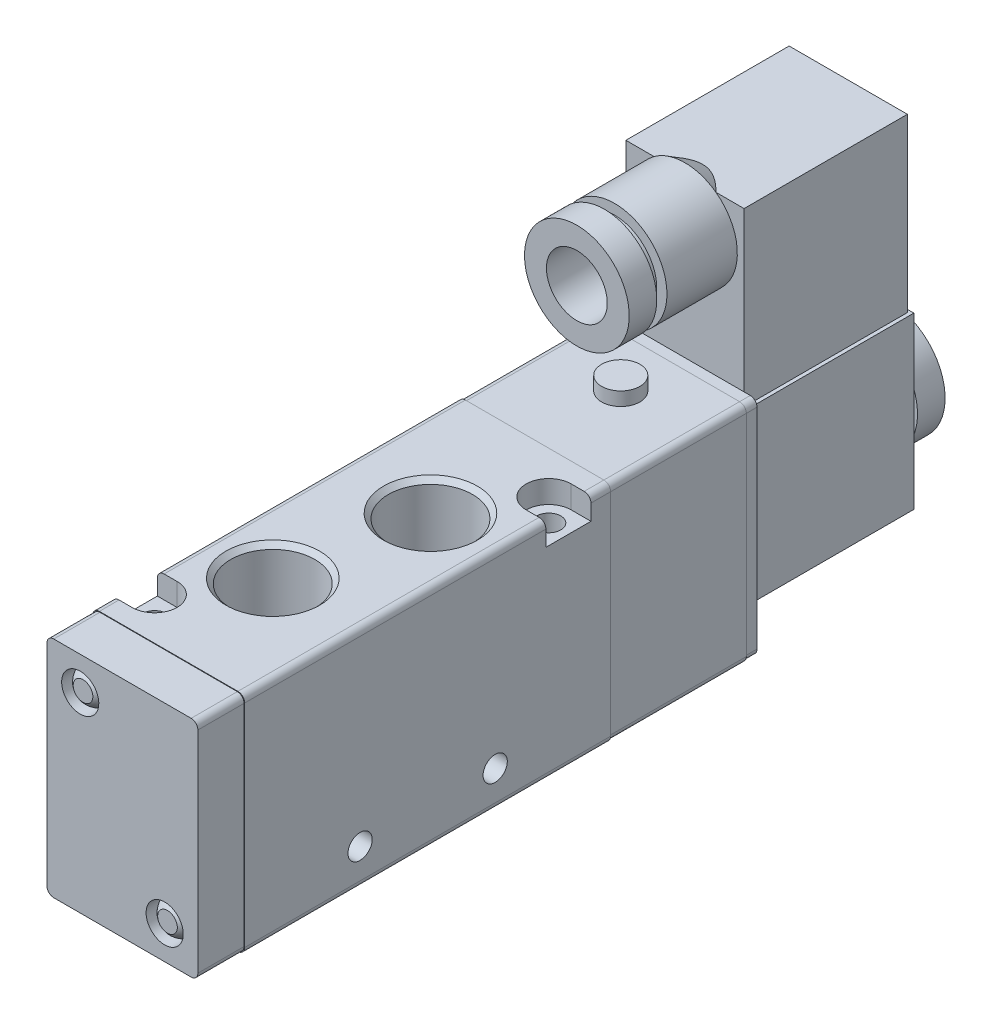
ISO-10303-21;
HEADER;
FILE_DESCRIPTION(('STEP AP214'),'2;1');
FILE_NAME('part.step','',(''),(''),'','','');
FILE_SCHEMA(('AUTOMOTIVE_DESIGN { 1 0 10303 214 1 1 1 1 }'));
ENDSEC;
DATA;
#1=APPLICATION_CONTEXT('core data for automotive mechanical design processes');
#2=APPLICATION_PROTOCOL_DEFINITION('international standard','automotive_design',2000,#1);
#3=PRODUCT_CONTEXT('',#1,'mechanical');
#4=PRODUCT('Part','Part','',(#3));
#5=PRODUCT_RELATED_PRODUCT_CATEGORY('part','',(#4));
#6=PRODUCT_DEFINITION_FORMATION('','',#4);
#7=PRODUCT_DEFINITION_CONTEXT('part definition',#1,'design');
#8=PRODUCT_DEFINITION('design','',#6,#7);
#9=PRODUCT_DEFINITION_SHAPE('','',#8);
#10=(LENGTH_UNIT() NAMED_UNIT(*) SI_UNIT(.MILLI.,.METRE.));
#11=(NAMED_UNIT(*) PLANE_ANGLE_UNIT() SI_UNIT($,.RADIAN.));
#12=(NAMED_UNIT(*) SI_UNIT($,.STERADIAN.) SOLID_ANGLE_UNIT());
#13=UNCERTAINTY_MEASURE_WITH_UNIT(LENGTH_MEASURE(1.E-05),#10,'distance_accuracy_value','');
#14=(GEOMETRIC_REPRESENTATION_CONTEXT(3) GLOBAL_UNCERTAINTY_ASSIGNED_CONTEXT((#13)) GLOBAL_UNIT_ASSIGNED_CONTEXT((#10,
#11,#12)) REPRESENTATION_CONTEXT('',''));
#15=CARTESIAN_POINT('',(0.,0.,0.));
#16=DIRECTION('',(0.,0.,1.));
#17=DIRECTION('',(1.,0.,0.));
#18=AXIS2_PLACEMENT_3D('',#15,#16,#17);
#19=CARTESIAN_POINT('',(0.,47.5,0.));
#20=DIRECTION('',(0.,1.,0.));
#21=DIRECTION('',(0.,0.,1.));
#22=AXIS2_PLACEMENT_3D('',#19,#20,#21);
#23=PLANE('',#22);
#24=DIRECTION('',(1.,0.,0.));
#25=VECTOR('',#24,1.);
#26=CARTESIAN_POINT('',(-10.5,47.5,-91.7));
#27=LINE('',#26,#25);
#28=CARTESIAN_POINT('',(-10.5,47.5,-91.7));
#29=VERTEX_POINT('',#28);
#30=CARTESIAN_POINT('',(-5.49909083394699,47.5,-91.7));
#31=VERTEX_POINT('',#30);
#32=EDGE_CURVE('E374',#29,#31,#27,.T.);
#33=ORIENTED_EDGE('',*,*,#32,.T.);
#34=CARTESIAN_POINT('',(-12.5563156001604,47.5,-82.4756193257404));
#35=CARTESIAN_POINT('',(-12.2854300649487,47.5,-82.8783492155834));
#36=CARTESIAN_POINT('',(-12.0130171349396,47.5,-83.2800624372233));
#37=CARTESIAN_POINT('',(-11.4643400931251,47.5,-84.0809387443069));
#38=CARTESIAN_POINT('',(-11.1880753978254,47.5,-84.4801014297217));
#39=CARTESIAN_POINT('',(-10.6291432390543,47.5,-85.2778590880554));
#40=CARTESIAN_POINT('',(-10.346445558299,47.5,-85.6764329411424));
#41=CARTESIAN_POINT('',(-9.77538003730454,47.5,-86.4694510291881));
#42=CARTESIAN_POINT('',(-9.48701267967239,47.5,-86.8638956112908));
#43=CARTESIAN_POINT('',(-8.8772972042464,47.5,-87.6822755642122));
#44=CARTESIAN_POINT('',(-8.55529204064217,47.5,-88.105724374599));
#45=CARTESIAN_POINT('',(-8.06402593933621,47.5,-88.7345495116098));
#46=CARTESIAN_POINT('',(-7.89886739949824,47.5,-88.9431323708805));
#47=CARTESIAN_POINT('',(-7.56538226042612,47.5,-89.3577469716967));
#48=CARTESIAN_POINT('',(-7.39705573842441,47.5,-89.5637787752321));
#49=CARTESIAN_POINT('',(-7.05722917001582,47.5,-89.9721908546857));
#50=CARTESIAN_POINT('',(-6.88573989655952,47.5,-90.1745800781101));
#51=CARTESIAN_POINT('',(-6.53850421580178,47.5,-90.5756648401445));
#52=CARTESIAN_POINT('',(-6.36275803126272,47.5,-90.7743605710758));
#53=CARTESIAN_POINT('',(-6.0063360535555,47.5,-91.167113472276));
#54=CARTESIAN_POINT('',(-5.82566273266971,47.5,-91.3611728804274));
#55=CARTESIAN_POINT('',(-5.45839728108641,47.5,-91.7435890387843));
#56=CARTESIAN_POINT('',(-5.27180601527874,47.5,-91.931946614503));
#57=CARTESIAN_POINT('',(-4.98033698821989,47.5,-92.2151184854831));
#58=CARTESIAN_POINT('',(-4.87799114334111,47.5,-92.3125400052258));
#59=CARTESIAN_POINT('',(-4.67107998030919,47.5,-92.5049966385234));
#60=CARTESIAN_POINT('',(-4.56651462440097,47.5,-92.6000317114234));
#61=CARTESIAN_POINT('',(-4.24903294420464,47.5,-92.8811418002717));
#62=CARTESIAN_POINT('',(-4.03243258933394,47.5,-93.0631218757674));
#63=CARTESIAN_POINT('',(-3.58974847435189,47.5,-93.4103924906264));
#64=CARTESIAN_POINT('',(-3.3637852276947,47.5,-93.5758354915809));
#65=CARTESIAN_POINT('',(-2.89832485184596,47.5,-93.8864098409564));
#66=CARTESIAN_POINT('',(-2.65884314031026,47.5,-94.031563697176));
#67=CARTESIAN_POINT('',(-2.28848075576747,47.5,-94.2279329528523));
#68=CARTESIAN_POINT('',(-2.16323404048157,47.5,-94.2898040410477));
#69=CARTESIAN_POINT('',(-1.90892978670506,47.5,-94.4052051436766));
#70=CARTESIAN_POINT('',(-1.77987253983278,47.5,-94.4587357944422));
#71=CARTESIAN_POINT('',(-1.51822353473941,47.5,-94.5560499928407));
#72=CARTESIAN_POINT('',(-1.38563471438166,47.5,-94.5998413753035));
#73=CARTESIAN_POINT('',(-1.11730284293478,47.5,-94.676332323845));
#74=CARTESIAN_POINT('',(-0.981560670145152,47.5,-94.7090349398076));
#75=CARTESIAN_POINT('',(-0.70598608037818,47.5,-94.7624464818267));
#76=CARTESIAN_POINT('',(-0.566123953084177,47.5,-94.7830039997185));
#77=CARTESIAN_POINT('',(-0.285066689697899,47.5,-94.8105820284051));
#78=CARTESIAN_POINT('',(-0.143871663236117,47.5,-94.817603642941));
#79=CARTESIAN_POINT('',(0.138470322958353,47.5,-94.8177775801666));
#80=CARTESIAN_POINT('',(0.279617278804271,47.5,-94.8109355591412));
#81=CARTESIAN_POINT('',(0.560597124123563,47.5,-94.7837206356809));
#82=CARTESIAN_POINT('',(0.700429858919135,47.5,-94.7633461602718));
#83=CARTESIAN_POINT('',(0.990854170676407,47.5,-94.7074205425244));
#84=CARTESIAN_POINT('',(1.1412013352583,47.5,-94.6706082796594));
#85=CARTESIAN_POINT('',(1.43795611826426,47.5,-94.583515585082));
#86=CARTESIAN_POINT('',(1.58436203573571,47.5,-94.5332294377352));
#87=CARTESIAN_POINT('',(1.87297896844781,47.5,-94.4209647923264));
#88=CARTESIAN_POINT('',(2.01517907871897,47.5,-94.3589585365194));
#89=CARTESIAN_POINT('',(2.29486633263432,47.5,-94.2251781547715));
#90=CARTESIAN_POINT('',(2.43235339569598,47.5,-94.153403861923));
#91=CARTESIAN_POINT('',(2.72253274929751,47.5,-93.9906190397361));
#92=CARTESIAN_POINT('',(2.87450445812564,47.5,-93.8983306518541));
#93=CARTESIAN_POINT('',(3.17287040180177,47.5,-93.7050988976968));
#94=CARTESIAN_POINT('',(3.3192626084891,47.5,-93.6041524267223));
#95=CARTESIAN_POINT('',(3.60713919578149,47.5,-93.3951247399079));
#96=CARTESIAN_POINT('',(3.74861658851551,47.5,-93.2870339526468));
#97=CARTESIAN_POINT('',(4.0270091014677,47.5,-93.0651218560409));
#98=CARTESIAN_POINT('',(4.16392366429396,47.5,-92.9512998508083));
#99=CARTESIAN_POINT('',(4.4354804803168,47.5,-92.7174037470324));
#100=CARTESIAN_POINT('',(4.57006822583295,47.5,-92.5972665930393));
#101=CARTESIAN_POINT('',(4.83555082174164,47.5,-92.3529851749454));
#102=CARTESIAN_POINT('',(4.96644557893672,47.5,-92.2288408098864));
#103=CARTESIAN_POINT('',(5.22484154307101,47.5,-91.9773217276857));
#104=CARTESIAN_POINT('',(5.35234588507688,47.5,-91.8499502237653));
#105=CARTESIAN_POINT('',(5.60445038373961,47.5,-91.592383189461));
#106=CARTESIAN_POINT('',(5.72905066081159,47.5,-91.4621877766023));
#107=CARTESIAN_POINT('',(6.13566200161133,47.5,-91.0289535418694));
#108=CARTESIAN_POINT('',(6.41220633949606,47.5,-90.7207773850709));
#109=CARTESIAN_POINT('',(6.95490719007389,47.5,-90.0953795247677));
#110=CARTESIAN_POINT('',(7.22106139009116,47.5,-89.7781558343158));
#111=CARTESIAN_POINT('',(7.74534184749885,47.5,-89.1367674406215));
#112=CARTESIAN_POINT('',(8.00346197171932,47.5,-88.8125977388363));
#113=CARTESIAN_POINT('',(8.51308347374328,47.5,-88.1591580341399));
#114=CARTESIAN_POINT('',(8.76458539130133,47.5,-87.8298884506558));
#115=CARTESIAN_POINT('',(9.26309460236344,47.5,-87.1661662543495));
#116=CARTESIAN_POINT('',(9.51008305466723,47.5,-86.8316995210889));
#117=CARTESIAN_POINT('',(9.99960837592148,47.5,-86.1595211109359));
#118=CARTESIAN_POINT('',(10.2421451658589,47.5,-85.8218093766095));
#119=CARTESIAN_POINT('',(10.7233981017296,47.5,-85.1438931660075));
#120=CARTESIAN_POINT('',(10.9621158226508,47.5,-84.8036898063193));
#121=CARTESIAN_POINT('',(11.436414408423,47.5,-84.1211019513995));
#122=CARTESIAN_POINT('',(11.6719952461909,47.5,-83.7787174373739));
#123=CARTESIAN_POINT('',(12.3180915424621,47.5,-82.8318613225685));
#124=CARTESIAN_POINT('',(12.7258225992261,47.5,-82.2254898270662));
#125=CARTESIAN_POINT('',(13.5350009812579,47.5,-81.0084772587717));
#126=CARTESIAN_POINT('',(13.9364475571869,47.5,-80.3978356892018));
#127=CARTESIAN_POINT('',(14.7316259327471,47.5,-79.177473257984));
#128=CARTESIAN_POINT('',(15.1253916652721,47.5,-78.5677744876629));
#129=CARTESIAN_POINT('',(15.7130348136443,47.5,-77.6513702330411));
#130=CARTESIAN_POINT('',(15.9083997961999,47.5,-77.3456167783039));
#131=CARTESIAN_POINT('',(16.2982305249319,47.5,-76.7335384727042));
#132=CARTESIAN_POINT('',(16.4926962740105,47.5,-76.4272136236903));
#133=CARTESIAN_POINT('',(16.6867590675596,47.5,-76.1206336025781));
#134=B_SPLINE_CURVE_WITH_KNOTS('',3,(#34,#35,#36,#37,#38,#39,#40,#41,#42,#43,#44,#45,#46,#47,
#48,#49,#50,#51,#52,#53,#54,#55,#56,#57,#58,#59,#60,#61,#62,#63,#64,#65,#66,#67,#68,#69,#70,#71,
#72,#73,#74,#75,#76,#77,#78,#79,#80,#81,#82,#83,#84,#85,#86,#87,#88,#89,#90,#91,#92,#93,#94,#95,
#96,#97,#98,#99,#100,#101,#102,#103,#104,#105,#106,#107,#108,#109,#110,#111,#112,#113,#114,#115,
#116,#117,#118,#119,#120,#121,#122,#123,#124,#125,#126,#127,#128,#129,#130,#131,#132,#133),
.UNSPECIFIED.,.F.,.F.,(4,2,2,2,2,2,2,2,2,2,2,2,2,2,2,2,2,2,2,2,2,2,2,2,2,2,2,2,2,2,2,2,2,2,2,2,
2,2,2,2,2,2,2,2,2,2,2,2,2,4),(0.,1.45607721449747,2.91237745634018,4.37828563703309,
5.84406957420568,7.43983326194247,8.23796766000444,9.03608262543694,9.83185346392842,
10.627582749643,11.422919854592,12.2181412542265,12.6420061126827,13.065878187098,
13.9140491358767,14.7534927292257,15.5919975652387,16.0108400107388,16.4296504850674,
16.8481228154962,17.266479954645,17.6899481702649,18.1133818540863,18.5366428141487,
18.9599529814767,19.4235981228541,19.8874402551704,20.3523950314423,20.8173577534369,
21.3503886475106,21.8836114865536,22.417563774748,22.951581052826,23.4927068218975,
24.0338462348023,24.5744665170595,25.1150643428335,26.3568984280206,27.5990073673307,
28.8420423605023,30.084975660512,31.3322650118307,32.5795764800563,33.8263595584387,
35.0731533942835,37.2652124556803,39.4575309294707,41.6349072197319,42.7234251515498,
43.8119395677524),.UNSPECIFIED.);
#135=CARTESIAN_POINT('',(5.49909083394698,47.5,-91.7));
#136=VERTEX_POINT('',#135);
#137=EDGE_CURVE('E45',#31,#136,#134,.T.);
#138=ORIENTED_EDGE('',*,*,#137,.T.);
#139=CARTESIAN_POINT('',(10.5,47.5,-91.7));
#140=VERTEX_POINT('',#139);
#141=EDGE_CURVE('E377',#136,#140,#27,.T.);
#142=ORIENTED_EDGE('',*,*,#141,.T.);
#143=DIRECTION('',(0.,0.,-1.));
#144=VECTOR('',#143,1.);
#145=CARTESIAN_POINT('',(10.5,47.5,-91.7));
#146=LINE('',#145,#144);
#147=CARTESIAN_POINT('',(10.5,47.5,-120.7));
#148=VERTEX_POINT('',#147);
#149=EDGE_CURVE('E381',#140,#148,#146,.T.);
#150=ORIENTED_EDGE('',*,*,#149,.T.);
#151=DIRECTION('',(-1.,0.,0.));
#152=VECTOR('',#151,1.);
#153=CARTESIAN_POINT('',(10.5,47.5,-120.7));
#154=LINE('',#153,#152);
#155=CARTESIAN_POINT('',(-10.5,47.5,-120.7));
#156=VERTEX_POINT('',#155);
#157=EDGE_CURVE('E383',#148,#156,#154,.T.);
#158=ORIENTED_EDGE('',*,*,#157,.T.);
#159=DIRECTION('',(0.,0.,1.));
#160=VECTOR('',#159,1.);
#161=CARTESIAN_POINT('',(-10.5,47.5,-120.7));
#162=LINE('',#161,#160);
#163=EDGE_CURVE('E379',#156,#29,#162,.T.);
#164=ORIENTED_EDGE('',*,*,#163,.T.);
#165=EDGE_LOOP('',(#33,#138,#142,#150,#158,#164));
#166=FACE_BOUND('',#165,.T.);
#167=ADVANCED_FACE('F37',(#166),#23,.T.);
#168=CARTESIAN_POINT('',(0.,17.,0.));
#169=DIRECTION('',(0.,1.,0.));
#170=DIRECTION('',(0.,0.,1.));
#171=AXIS2_PLACEMENT_3D('',#168,#169,#170);
#172=PLANE('',#171);
#173=DIRECTION('',(-1.,0.,0.));
#174=VECTOR('',#173,1.);
#175=CARTESIAN_POINT('',(11.15,17.,-121.2));
#176=LINE('',#175,#174);
#177=CARTESIAN_POINT('',(11.15,17.,-121.2));
#178=VERTEX_POINT('',#177);
#179=CARTESIAN_POINT('',(-11.15,17.,-121.2));
#180=VERTEX_POINT('',#179);
#181=EDGE_CURVE('E414',#178,#180,#176,.T.);
#182=ORIENTED_EDGE('',*,*,#181,.T.);
#183=DIRECTION('',(0.,0.,1.));
#184=VECTOR('',#183,1.);
#185=CARTESIAN_POINT('',(-11.15,17.,-121.2));
#186=LINE('',#185,#184);
#187=CARTESIAN_POINT('',(-11.15,17.,-91.2));
#188=VERTEX_POINT('',#187);
#189=EDGE_CURVE('E417',#180,#188,#186,.T.);
#190=ORIENTED_EDGE('',*,*,#189,.T.);
#191=DIRECTION('',(1.,0.,0.));
#192=VECTOR('',#191,1.);
#193=CARTESIAN_POINT('',(-11.15,17.,-91.2));
#194=LINE('',#193,#192);
#195=CARTESIAN_POINT('',(11.15,17.,-91.2));
#196=VERTEX_POINT('',#195);
#197=EDGE_CURVE('E421',#188,#196,#194,.T.);
#198=ORIENTED_EDGE('',*,*,#197,.T.);
#199=DIRECTION('',(0.,0.,-1.));
#200=VECTOR('',#199,1.);
#201=CARTESIAN_POINT('',(11.15,17.,-91.2));
#202=LINE('',#201,#200);
#203=EDGE_CURVE('E424',#196,#178,#202,.T.);
#204=ORIENTED_EDGE('',*,*,#203,.T.);
#205=EDGE_LOOP('',(#182,#190,#198,#204));
#206=FACE_BOUND('',#205,.T.);
#207=DIRECTION('',(-1.,0.,0.));
#208=VECTOR('',#207,1.);
#209=CARTESIAN_POINT('',(0.,17.,-91.7));
#210=LINE('',#209,#208);
#211=CARTESIAN_POINT('',(10.5,17.,-91.7));
#212=VERTEX_POINT('',#211);
#213=CARTESIAN_POINT('',(-10.5,17.,-91.7));
#214=VERTEX_POINT('',#213);
#215=EDGE_CURVE('E875',#212,#214,#210,.T.);
#216=ORIENTED_EDGE('',*,*,#215,.T.);
#217=DIRECTION('',(0.,0.,-1.));
#218=VECTOR('',#217,1.);
#219=CARTESIAN_POINT('',(-10.5,17.,0.));
#220=LINE('',#219,#218);
#221=CARTESIAN_POINT('',(-10.5,17.,-120.7));
#222=VERTEX_POINT('',#221);
#223=EDGE_CURVE('E363',#214,#222,#220,.T.);
#224=ORIENTED_EDGE('',*,*,#223,.T.);
#225=DIRECTION('',(1.,0.,0.));
#226=VECTOR('',#225,1.);
#227=CARTESIAN_POINT('',(0.,17.,-120.7));
#228=LINE('',#227,#226);
#229=CARTESIAN_POINT('',(10.5,17.,-120.7));
#230=VERTEX_POINT('',#229);
#231=EDGE_CURVE('E869',#222,#230,#228,.T.);
#232=ORIENTED_EDGE('',*,*,#231,.T.);
#233=DIRECTION('',(0.,0.,1.));
#234=VECTOR('',#233,1.);
#235=CARTESIAN_POINT('',(10.5,17.,0.));
#236=LINE('',#235,#234);
#237=EDGE_CURVE('E872',#230,#212,#236,.T.);
#238=ORIENTED_EDGE('',*,*,#237,.T.);
#239=EDGE_LOOP('',(#216,#224,#232,#238));
#240=FACE_BOUND('',#239,.T.);
#241=ADVANCED_FACE('F923',(#206,#240),#172,.T.);
#242=CARTESIAN_POINT('',(-12.3,18.8,0.));
#243=DIRECTION('',(0.,0.,1.));
#244=DIRECTION('',(1.,0.,0.));
#245=AXIS2_PLACEMENT_3D('',#242,#243,#244);
#246=PLANE('',#245);
#247=CARTESIAN_POINT('',(-12.3,18.8,0.));
#248=DIRECTION('',(0.,0.,1.));
#249=DIRECTION('',(1.,0.,0.));
#250=AXIS2_PLACEMENT_3D('',#247,#248,#249);
#251=CIRCLE('',#250,1.2);
#252=CARTESIAN_POINT('',(-12.3,20.,0.));
#253=VERTEX_POINT('',#252);
#254=CARTESIAN_POINT('',(-13.5,18.8,0.));
#255=VERTEX_POINT('',#254);
#256=EDGE_CURVE('E766',#253,#255,#251,.T.);
#257=ORIENTED_EDGE('',*,*,#256,.T.);
#258=DIRECTION('',(0.,-1.,0.));
#259=VECTOR('',#258,1.);
#260=CARTESIAN_POINT('',(-13.5,18.8,0.));
#261=LINE('',#260,#259);
#262=CARTESIAN_POINT('',(-13.5,-18.8,0.));
#263=VERTEX_POINT('',#262);
#264=EDGE_CURVE('E795',#255,#263,#261,.T.);
#265=ORIENTED_EDGE('',*,*,#264,.T.);
#266=CARTESIAN_POINT('',(-12.3,-18.8,0.));
#267=DIRECTION('',(0.,0.,1.));
#268=DIRECTION('',(1.,0.,0.));
#269=AXIS2_PLACEMENT_3D('',#266,#267,#268);
#270=CIRCLE('',#269,1.2);
#271=CARTESIAN_POINT('',(-12.3,-20.,0.));
#272=VERTEX_POINT('',#271);
#273=EDGE_CURVE('E798',#263,#272,#270,.T.);
#274=ORIENTED_EDGE('',*,*,#273,.T.);
#275=DIRECTION('',(1.,0.,0.));
#276=VECTOR('',#275,1.);
#277=CARTESIAN_POINT('',(-12.3,-20.,0.));
#278=LINE('',#277,#276);
#279=CARTESIAN_POINT('',(12.3,-20.,0.));
#280=VERTEX_POINT('',#279);
#281=EDGE_CURVE('E801',#272,#280,#278,.T.);
#282=ORIENTED_EDGE('',*,*,#281,.T.);
#283=CARTESIAN_POINT('',(12.3,-18.8,0.));
#284=DIRECTION('',(0.,0.,1.));
#285=DIRECTION('',(1.,0.,0.));
#286=AXIS2_PLACEMENT_3D('',#283,#284,#285);
#287=CIRCLE('',#286,1.2);
#288=CARTESIAN_POINT('',(13.5,-18.8,0.));
#289=VERTEX_POINT('',#288);
#290=EDGE_CURVE('E804',#280,#289,#287,.T.);
#291=ORIENTED_EDGE('',*,*,#290,.T.);
#292=DIRECTION('',(0.,1.,0.));
#293=VECTOR('',#292,1.);
#294=CARTESIAN_POINT('',(13.5,-18.8,0.));
#295=LINE('',#294,#293);
#296=CARTESIAN_POINT('',(13.5,18.8,0.));
#297=VERTEX_POINT('',#296);
#298=EDGE_CURVE('E807',#289,#297,#295,.T.);
#299=ORIENTED_EDGE('',*,*,#298,.T.);
#300=CARTESIAN_POINT('',(12.3,18.8,0.));
#301=DIRECTION('',(0.,0.,1.));
#302=DIRECTION('',(1.,0.,0.));
#303=AXIS2_PLACEMENT_3D('',#300,#301,#302);
#304=CIRCLE('',#303,1.2);
#305=CARTESIAN_POINT('',(12.3,20.,0.));
#306=VERTEX_POINT('',#305);
#307=EDGE_CURVE('E810',#297,#306,#304,.T.);
#308=ORIENTED_EDGE('',*,*,#307,.T.);
#309=DIRECTION('',(-1.,0.,0.));
#310=VECTOR('',#309,1.);
#311=CARTESIAN_POINT('',(12.3,20.,0.));
#312=LINE('',#311,#310);
#313=EDGE_CURVE('E771',#306,#253,#312,.T.);
#314=ORIENTED_EDGE('',*,*,#313,.T.);
#315=EDGE_LOOP('',(#257,#265,#274,#282,#291,#299,#308,#314));
#316=FACE_BOUND('',#315,.T.);
#317=DIRECTION('',(0.,-1.,0.));
#318=VECTOR('',#317,1.);
#319=CARTESIAN_POINT('',(-13.4,18.7,0.));
#320=LINE('',#319,#318);
#321=CARTESIAN_POINT('',(-13.4,18.7,0.));
#322=VERTEX_POINT('',#321);
#323=CARTESIAN_POINT('',(-13.4,-18.7,0.));
#324=VERTEX_POINT('',#323);
#325=EDGE_CURVE('E603',#322,#324,#320,.T.);
#326=ORIENTED_EDGE('',*,*,#325,.F.);
#327=CARTESIAN_POINT('',(-12.2,18.7,0.));
#328=DIRECTION('',(0.,0.,1.));
#329=DIRECTION('',(1.,0.,0.));
#330=AXIS2_PLACEMENT_3D('',#327,#328,#329);
#331=CIRCLE('',#330,1.2);
#332=CARTESIAN_POINT('',(-12.2,19.9,0.));
#333=VERTEX_POINT('',#332);
#334=EDGE_CURVE('E581',#333,#322,#331,.T.);
#335=ORIENTED_EDGE('',*,*,#334,.F.);
#336=DIRECTION('',(-1.,0.,0.));
#337=VECTOR('',#336,1.);
#338=CARTESIAN_POINT('',(12.2,19.9,0.));
#339=LINE('',#338,#337);
#340=CARTESIAN_POINT('',(12.2,19.9,0.));
#341=VERTEX_POINT('',#340);
#342=EDGE_CURVE('E586',#341,#333,#339,.T.);
#343=ORIENTED_EDGE('',*,*,#342,.F.);
#344=CARTESIAN_POINT('',(12.2,18.7,0.));
#345=DIRECTION('',(0.,0.,1.));
#346=DIRECTION('',(1.,0.,0.));
#347=AXIS2_PLACEMENT_3D('',#344,#345,#346);
#348=CIRCLE('',#347,1.2);
#349=CARTESIAN_POINT('',(13.4,18.7,0.));
#350=VERTEX_POINT('',#349);
#351=EDGE_CURVE('E613',#350,#341,#348,.T.);
#352=ORIENTED_EDGE('',*,*,#351,.F.);
#353=DIRECTION('',(0.,1.,0.));
#354=VECTOR('',#353,1.);
#355=CARTESIAN_POINT('',(13.4,-18.7,0.));
#356=LINE('',#355,#354);
#357=CARTESIAN_POINT('',(13.4,-18.7,0.));
#358=VERTEX_POINT('',#357);
#359=EDGE_CURVE('E611',#358,#350,#356,.T.);
#360=ORIENTED_EDGE('',*,*,#359,.F.);
#361=CARTESIAN_POINT('',(12.2,-18.7,0.));
#362=DIRECTION('',(0.,0.,1.));
#363=DIRECTION('',(1.,0.,0.));
#364=AXIS2_PLACEMENT_3D('',#361,#362,#363);
#365=CIRCLE('',#364,1.2);
#366=CARTESIAN_POINT('',(12.2,-19.9,0.));
#367=VERTEX_POINT('',#366);
#368=EDGE_CURVE('E609',#367,#358,#365,.T.);
#369=ORIENTED_EDGE('',*,*,#368,.F.);
#370=DIRECTION('',(1.,0.,0.));
#371=VECTOR('',#370,1.);
#372=CARTESIAN_POINT('',(-12.2,-19.9,0.));
#373=LINE('',#372,#371);
#374=CARTESIAN_POINT('',(-12.2,-19.9,0.));
#375=VERTEX_POINT('',#374);
#376=EDGE_CURVE('E607',#375,#367,#373,.T.);
#377=ORIENTED_EDGE('',*,*,#376,.F.);
#378=CARTESIAN_POINT('',(-12.2,-18.7,0.));
#379=DIRECTION('',(0.,0.,1.));
#380=DIRECTION('',(1.,0.,0.));
#381=AXIS2_PLACEMENT_3D('',#378,#379,#380);
#382=CIRCLE('',#381,1.19999999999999);
#383=EDGE_CURVE('E605',#324,#375,#382,.T.);
#384=ORIENTED_EDGE('',*,*,#383,.F.);
#385=EDGE_LOOP('',(#326,#335,#343,#352,#360,#369,#377,#384));
#386=FACE_BOUND('',#385,.T.);
#387=ADVANCED_FACE('F927',(#316,#386),#246,.T.);
#388=CARTESIAN_POINT('',(12.3,18.8,-65.));
#389=DIRECTION('',(0.,0.,1.));
#390=DIRECTION('',(1.,0.,0.));
#391=AXIS2_PLACEMENT_3D('',#388,#389,#390);
#392=CYLINDRICAL_SURFACE('',#391,1.2);
#393=CARTESIAN_POINT('',(12.3,18.8,-61.5));
#394=DIRECTION('',(0.,0.,-1.));
#395=DIRECTION('',(-1.,0.,0.));
#396=AXIS2_PLACEMENT_3D('',#393,#394,#395);
#397=CIRCLE('',#396,1.2);
#398=CARTESIAN_POINT('',(13.5,18.8,-61.5));
#399=VERTEX_POINT('',#398);
#400=CARTESIAN_POINT('',(12.3,20.,-61.5));
#401=VERTEX_POINT('',#400);
#402=EDGE_CURVE('E725',#399,#401,#397,.F.);
#403=ORIENTED_EDGE('',*,*,#402,.F.);
#404=DIRECTION('',(0.,0.,1.));
#405=VECTOR('',#404,1.);
#406=CARTESIAN_POINT('',(13.5,18.8,-65.));
#407=LINE('',#406,#405);
#408=CARTESIAN_POINT('',(13.5,18.8,-65.));
#409=VERTEX_POINT('',#408);
#410=EDGE_CURVE('E824',#409,#399,#407,.T.);
#411=ORIENTED_EDGE('',*,*,#410,.F.);
#412=CARTESIAN_POINT('',(12.3,18.8,-65.));
#413=DIRECTION('',(0.,0.,1.));
#414=DIRECTION('',(1.,0.,0.));
#415=AXIS2_PLACEMENT_3D('',#412,#413,#414);
#416=CIRCLE('',#415,1.2);
#417=CARTESIAN_POINT('',(12.3,20.,-65.));
#418=VERTEX_POINT('',#417);
#419=EDGE_CURVE('E786',#409,#418,#416,.T.);
#420=ORIENTED_EDGE('',*,*,#419,.T.);
#421=DIRECTION('',(0.,0.,1.));
#422=VECTOR('',#421,1.);
#423=CARTESIAN_POINT('',(12.3,20.,-65.));
#424=LINE('',#423,#422);
#425=EDGE_CURVE('E820',#418,#401,#424,.T.);
#426=ORIENTED_EDGE('',*,*,#425,.T.);
#427=EDGE_LOOP('',(#403,#411,#420,#426));
#428=FACE_BOUND('',#427,.T.);
#429=ADVANCED_FACE('F933',(#428),#392,.T.);
#430=CARTESIAN_POINT('',(10.,-20.,-57.5));
#431=DIRECTION('',(0.,1.,0.));
#432=DIRECTION('',(0.,0.,1.));
#433=AXIS2_PLACEMENT_3D('',#430,#431,#432);
#434=CYLINDRICAL_SURFACE('',#433,2.15);
#435=CARTESIAN_POINT('',(10.,-20.,-57.5));
#436=DIRECTION('',(0.,1.,0.));
#437=DIRECTION('',(0.,0.,1.));
#438=AXIS2_PLACEMENT_3D('',#435,#436,#437);
#439=CIRCLE('',#438,2.15);
#440=CARTESIAN_POINT('',(10.,-20.,-55.35));
#441=VERTEX_POINT('',#440);
#442=EDGE_CURVE('E760',#441,#441,#439,.T.);
#443=ORIENTED_EDGE('',*,*,#442,.F.);
#444=EDGE_LOOP('',(#443));
#445=FACE_BOUND('',#444,.T.);
#446=CARTESIAN_POINT('',(10.,16.,-57.5));
#447=DIRECTION('',(0.,1.,0.));
#448=DIRECTION('',(0.,0.,1.));
#449=AXIS2_PLACEMENT_3D('',#446,#447,#448);
#450=CIRCLE('',#449,2.15);
#451=CARTESIAN_POINT('',(10.,16.,-55.35));
#452=VERTEX_POINT('',#451);
#453=EDGE_CURVE('E716',#452,#452,#450,.F.);
#454=ORIENTED_EDGE('',*,*,#453,.F.);
#455=EDGE_LOOP('',(#454));
#456=FACE_BOUND('',#455,.T.);
#457=ADVANCED_FACE('F1198',(#445,#456),#434,.F.);
#458=CARTESIAN_POINT('',(-12.3,18.8,-65.));
#459=DIRECTION('',(0.,0.,1.));
#460=DIRECTION('',(1.,0.,0.));
#461=AXIS2_PLACEMENT_3D('',#458,#459,#460);
#462=CYLINDRICAL_SURFACE('',#461,1.2);
#463=CARTESIAN_POINT('',(-12.3,18.8,-11.5));
#464=DIRECTION('',(0.,0.,-1.));
#465=DIRECTION('',(-1.,0.,0.));
#466=AXIS2_PLACEMENT_3D('',#463,#464,#465);
#467=CIRCLE('',#466,1.2);
#468=CARTESIAN_POINT('',(-12.3,20.,-11.5));
#469=VERTEX_POINT('',#468);
#470=CARTESIAN_POINT('',(-13.5,18.8,-11.5));
#471=VERTEX_POINT('',#470);
#472=EDGE_CURVE('E758',#469,#471,#467,.F.);
#473=ORIENTED_EDGE('',*,*,#472,.F.);
#474=DIRECTION('',(0.,0.,1.));
#475=VECTOR('',#474,1.);
#476=CARTESIAN_POINT('',(-12.3,20.,-65.));
#477=LINE('',#476,#475);
#478=CARTESIAN_POINT('',(-12.3,20.,-65.));
#479=VERTEX_POINT('',#478);
#480=EDGE_CURVE('E815',#479,#469,#477,.T.);
#481=ORIENTED_EDGE('',*,*,#480,.F.);
#482=CARTESIAN_POINT('',(-12.3,18.8,-65.));
#483=DIRECTION('',(0.,0.,1.));
#484=DIRECTION('',(1.,0.,0.));
#485=AXIS2_PLACEMENT_3D('',#482,#483,#484);
#486=CIRCLE('',#485,1.2);
#487=CARTESIAN_POINT('',(-13.5,18.8,-65.));
#488=VERTEX_POINT('',#487);
#489=EDGE_CURVE('E767',#479,#488,#486,.T.);
#490=ORIENTED_EDGE('',*,*,#489,.T.);
#491=DIRECTION('',(0.,0.,1.));
#492=VECTOR('',#491,1.);
#493=CARTESIAN_POINT('',(-13.5,18.8,-65.));
#494=LINE('',#493,#492);
#495=EDGE_CURVE('E836',#488,#471,#494,.T.);
#496=ORIENTED_EDGE('',*,*,#495,.T.);
#497=EDGE_LOOP('',(#473,#481,#490,#496));
#498=FACE_BOUND('',#497,.T.);
#499=ADVANCED_FACE('F1201',(#498),#462,.T.);
#500=CARTESIAN_POINT('',(-10.,-20.,-7.49999999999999));
#501=DIRECTION('',(0.,1.,0.));
#502=DIRECTION('',(0.,0.,1.));
#503=AXIS2_PLACEMENT_3D('',#500,#501,#502);
#504=CYLINDRICAL_SURFACE('',#503,2.15);
#505=CARTESIAN_POINT('',(-10.,-20.,-7.49999999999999));
#506=DIRECTION('',(0.,1.,0.));
#507=DIRECTION('',(0.,0.,1.));
#508=AXIS2_PLACEMENT_3D('',#505,#506,#507);
#509=CIRCLE('',#508,2.15);
#510=CARTESIAN_POINT('',(-10.,-20.,-5.34999999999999));
#511=VERTEX_POINT('',#510);
#512=EDGE_CURVE('E763',#511,#511,#509,.T.);
#513=ORIENTED_EDGE('',*,*,#512,.F.);
#514=EDGE_LOOP('',(#513));
#515=FACE_BOUND('',#514,.T.);
#516=CARTESIAN_POINT('',(-10.,16.,-7.49999999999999));
#517=DIRECTION('',(0.,1.,0.));
#518=DIRECTION('',(0.,0.,1.));
#519=AXIS2_PLACEMENT_3D('',#516,#517,#518);
#520=CIRCLE('',#519,2.15);
#521=CARTESIAN_POINT('',(-10.,16.,-5.34999999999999));
#522=VERTEX_POINT('',#521);
#523=EDGE_CURVE('E748',#522,#522,#520,.F.);
#524=ORIENTED_EDGE('',*,*,#523,.F.);
#525=EDGE_LOOP('',(#524));
#526=FACE_BOUND('',#525,.T.);
#527=ADVANCED_FACE('F1203',(#515,#526),#504,.F.);
#528=CARTESIAN_POINT('',(-12.3,18.8,-3.49999999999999));
#529=DIRECTION('',(0.,0.,1.));
#530=DIRECTION('',(1.,0.,0.));
#531=AXIS2_PLACEMENT_3D('',#528,#529,#530);
#532=CIRCLE('',#531,1.2);
#533=CARTESIAN_POINT('',(-13.5,18.8,-3.49999999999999));
#534=VERTEX_POINT('',#533);
#535=CARTESIAN_POINT('',(-12.3,20.,-3.49999999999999));
#536=VERTEX_POINT('',#535);
#537=EDGE_CURVE('E756',#534,#536,#532,.F.);
#538=ORIENTED_EDGE('',*,*,#537,.F.);
#539=EDGE_CURVE('E792',#534,#255,#494,.T.);
#540=ORIENTED_EDGE('',*,*,#539,.T.);
#541=ORIENTED_EDGE('',*,*,#256,.F.);
#542=EDGE_CURVE('E819',#536,#253,#477,.T.);
#543=ORIENTED_EDGE('',*,*,#542,.F.);
#544=EDGE_LOOP('',(#538,#540,#541,#543));
#545=FACE_BOUND('',#544,.T.);
#546=ADVANCED_FACE('F39',(#545),#462,.T.);
#547=CARTESIAN_POINT('',(12.3,20.,-65.));
#548=DIRECTION('',(0.,1.,0.));
#549=DIRECTION('',(0.,0.,1.));
#550=AXIS2_PLACEMENT_3D('',#547,#548,#549);
#551=PLANE('',#550);
#552=CARTESIAN_POINT('',(2.,20.,-44.5));
#553=DIRECTION('',(0.,1.,0.));
#554=DIRECTION('',(0.,0.,1.));
#555=AXIS2_PLACEMENT_3D('',#552,#553,#554);
#556=CIRCLE('',#555,8.331);
#557=CARTESIAN_POINT('',(2.,20.,-36.169));
#558=VERTEX_POINT('',#557);
#559=EDGE_CURVE('E683',#558,#558,#556,.T.);
#560=ORIENTED_EDGE('',*,*,#559,.F.);
#561=EDGE_LOOP('',(#560));
#562=FACE_BOUND('',#561,.T.);
#563=CARTESIAN_POINT('',(-2.,20.,-20.5));
#564=DIRECTION('',(0.,-1.,0.));
#565=DIRECTION('',(0.,0.,-1.));
#566=AXIS2_PLACEMENT_3D('',#563,#564,#565);
#567=CIRCLE('',#566,8.331);
#568=CARTESIAN_POINT('',(-2.,20.,-28.831));
#569=VERTEX_POINT('',#568);
#570=EDGE_CURVE('E686',#569,#569,#567,.T.);
#571=ORIENTED_EDGE('',*,*,#570,.T.);
#572=EDGE_LOOP('',(#571));
#573=FACE_BOUND('',#572,.T.);
#574=DIRECTION('',(-1.,0.,0.));
#575=VECTOR('',#574,1.);
#576=CARTESIAN_POINT('',(13.5,20.,-61.5));
#577=LINE('',#576,#575);
#578=CARTESIAN_POINT('',(10.,20.,-61.5));
#579=VERTEX_POINT('',#578);
#580=EDGE_CURVE('E700',#401,#579,#577,.T.);
#581=ORIENTED_EDGE('',*,*,#580,.F.);
#582=ORIENTED_EDGE('',*,*,#425,.F.);
#583=DIRECTION('',(-1.,0.,0.));
#584=VECTOR('',#583,1.);
#585=CARTESIAN_POINT('',(12.3,20.,-65.));
#586=LINE('',#585,#584);
#587=EDGE_CURVE('E789',#418,#479,#586,.T.);
#588=ORIENTED_EDGE('',*,*,#587,.T.);
#589=ORIENTED_EDGE('',*,*,#480,.T.);
#590=DIRECTION('',(-1.,0.,0.));
#591=VECTOR('',#590,1.);
#592=CARTESIAN_POINT('',(-10.,20.,-11.5));
#593=LINE('',#592,#591);
#594=CARTESIAN_POINT('',(-10.,20.,-11.5));
#595=VERTEX_POINT('',#594);
#596=EDGE_CURVE('E727',#595,#469,#593,.T.);
#597=ORIENTED_EDGE('',*,*,#596,.F.);
#598=CARTESIAN_POINT('',(-10.,20.,-7.49999999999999));
#599=DIRECTION('',(0.,1.,0.));
#600=DIRECTION('',(0.,0.,1.));
#601=AXIS2_PLACEMENT_3D('',#598,#599,#600);
#602=CIRCLE('',#601,4.);
#603=CARTESIAN_POINT('',(-10.,20.,-3.49999999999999));
#604=VERTEX_POINT('',#603);
#605=EDGE_CURVE('E731',#604,#595,#602,.T.);
#606=ORIENTED_EDGE('',*,*,#605,.F.);
#607=DIRECTION('',(1.,0.,0.));
#608=VECTOR('',#607,1.);
#609=CARTESIAN_POINT('',(-13.5,20.,-3.49999999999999));
#610=LINE('',#609,#608);
#611=EDGE_CURVE('E742',#536,#604,#610,.T.);
#612=ORIENTED_EDGE('',*,*,#611,.F.);
#613=ORIENTED_EDGE('',*,*,#542,.T.);
#614=ORIENTED_EDGE('',*,*,#313,.F.);
#615=CARTESIAN_POINT('',(12.3,20.,-53.5));
#616=VERTEX_POINT('',#615);
#617=EDGE_CURVE('E823',#616,#306,#424,.T.);
#618=ORIENTED_EDGE('',*,*,#617,.F.);
#619=DIRECTION('',(1.,0.,0.));
#620=VECTOR('',#619,1.);
#621=CARTESIAN_POINT('',(10.,20.,-53.5));
#622=LINE('',#621,#620);
#623=CARTESIAN_POINT('',(10.,20.,-53.5));
#624=VERTEX_POINT('',#623);
#625=EDGE_CURVE('E710',#624,#616,#622,.T.);
#626=ORIENTED_EDGE('',*,*,#625,.F.);
#627=CARTESIAN_POINT('',(10.,20.,-57.5));
#628=DIRECTION('',(0.,1.,0.));
#629=DIRECTION('',(0.,0.,1.));
#630=AXIS2_PLACEMENT_3D('',#627,#628,#629);
#631=CIRCLE('',#630,4.);
#632=EDGE_CURVE('E695',#579,#624,#631,.T.);
#633=ORIENTED_EDGE('',*,*,#632,.F.);
#634=EDGE_LOOP('',(#581,#582,#588,#589,#597,#606,#612,#613,#614,#618,#626,#633));
#635=FACE_BOUND('',#634,.T.);
#636=ADVANCED_FACE('F1211',(#562,#573,#635),#551,.T.);
#637=CARTESIAN_POINT('',(12.3,18.8,-53.5));
#638=DIRECTION('',(0.,0.,1.));
#639=DIRECTION('',(1.,0.,0.));
#640=AXIS2_PLACEMENT_3D('',#637,#638,#639);
#641=CIRCLE('',#640,1.2);
#642=CARTESIAN_POINT('',(13.5,18.8,-53.5));
#643=VERTEX_POINT('',#642);
#644=EDGE_CURVE('E723',#616,#643,#641,.F.);
#645=ORIENTED_EDGE('',*,*,#644,.F.);
#646=ORIENTED_EDGE('',*,*,#617,.T.);
#647=ORIENTED_EDGE('',*,*,#307,.F.);
#648=EDGE_CURVE('E827',#643,#297,#407,.T.);
#649=ORIENTED_EDGE('',*,*,#648,.F.);
#650=EDGE_LOOP('',(#645,#646,#647,#649));
#651=FACE_BOUND('',#650,.T.);
#652=ADVANCED_FACE('F1214',(#651),#392,.T.);
#653=CARTESIAN_POINT('',(13.5,-18.8,-65.));
#654=DIRECTION('',(1.,0.,0.));
#655=DIRECTION('',(0.,0.,-1.));
#656=AXIS2_PLACEMENT_3D('',#653,#654,#655);
#657=PLANE('',#656);
#658=CARTESIAN_POINT('',(13.5,-13.5,-44.5));
#659=DIRECTION('',(1.,0.,0.));
#660=DIRECTION('',(0.,0.,-1.));
#661=AXIS2_PLACEMENT_3D('',#658,#659,#660);
#662=CIRCLE('',#661,2.15);
#663=CARTESIAN_POINT('',(13.5,-13.5,-46.65));
#664=VERTEX_POINT('',#663);
#665=EDGE_CURVE('E638',#664,#664,#662,.T.);
#666=ORIENTED_EDGE('',*,*,#665,.F.);
#667=EDGE_LOOP('',(#666));
#668=FACE_BOUND('',#667,.T.);
#669=CARTESIAN_POINT('',(13.5,-13.5,-20.5));
#670=DIRECTION('',(1.,0.,0.));
#671=DIRECTION('',(0.,0.,-1.));
#672=AXIS2_PLACEMENT_3D('',#669,#670,#671);
#673=CIRCLE('',#672,2.15);
#674=CARTESIAN_POINT('',(13.5,-13.5,-22.65));
#675=VERTEX_POINT('',#674);
#676=EDGE_CURVE('E644',#675,#675,#673,.T.);
#677=ORIENTED_EDGE('',*,*,#676,.F.);
#678=EDGE_LOOP('',(#677));
#679=FACE_BOUND('',#678,.T.);
#680=DIRECTION('',(0.,1.,0.));
#681=VECTOR('',#680,1.);
#682=CARTESIAN_POINT('',(13.5,16.,-61.5));
#683=LINE('',#682,#681);
#684=CARTESIAN_POINT('',(13.5,16.,-61.5));
#685=VERTEX_POINT('',#684);
#686=EDGE_CURVE('E717',#685,#399,#683,.T.);
#687=ORIENTED_EDGE('',*,*,#686,.F.);
#688=DIRECTION('',(0.,0.,-1.));
#689=VECTOR('',#688,1.);
#690=CARTESIAN_POINT('',(13.5,16.,-53.5));
#691=LINE('',#690,#689);
#692=CARTESIAN_POINT('',(13.5,16.,-53.5));
#693=VERTEX_POINT('',#692);
#694=EDGE_CURVE('E702',#693,#685,#691,.T.);
#695=ORIENTED_EDGE('',*,*,#694,.F.);
#696=DIRECTION('',(0.,1.,0.));
#697=VECTOR('',#696,1.);
#698=CARTESIAN_POINT('',(13.5,16.,-53.5));
#699=LINE('',#698,#697);
#700=EDGE_CURVE('E719',#693,#643,#699,.T.);
#701=ORIENTED_EDGE('',*,*,#700,.T.);
#702=ORIENTED_EDGE('',*,*,#648,.T.);
#703=ORIENTED_EDGE('',*,*,#298,.F.);
#704=DIRECTION('',(0.,0.,1.));
#705=VECTOR('',#704,1.);
#706=CARTESIAN_POINT('',(13.5,-18.8,-65.));
#707=LINE('',#706,#705);
#708=CARTESIAN_POINT('',(13.5,-18.8,-65.));
#709=VERTEX_POINT('',#708);
#710=EDGE_CURVE('E828',#709,#289,#707,.T.);
#711=ORIENTED_EDGE('',*,*,#710,.F.);
#712=DIRECTION('',(0.,1.,0.));
#713=VECTOR('',#712,1.);
#714=CARTESIAN_POINT('',(13.5,-18.8,-65.));
#715=LINE('',#714,#713);
#716=EDGE_CURVE('E783',#709,#409,#715,.T.);
#717=ORIENTED_EDGE('',*,*,#716,.T.);
#718=ORIENTED_EDGE('',*,*,#410,.T.);
#719=EDGE_LOOP('',(#687,#695,#701,#702,#703,#711,#717,#718));
#720=FACE_BOUND('',#719,.T.);
#721=ADVANCED_FACE('F1218',(#668,#679,#720),#657,.T.);
#722=CARTESIAN_POINT('',(12.3,-18.8,-65.));
#723=DIRECTION('',(0.,0.,1.));
#724=DIRECTION('',(1.,0.,0.));
#725=AXIS2_PLACEMENT_3D('',#722,#723,#724);
#726=CYLINDRICAL_SURFACE('',#725,1.2);
#727=ORIENTED_EDGE('',*,*,#290,.F.);
#728=DIRECTION('',(0.,0.,1.));
#729=VECTOR('',#728,1.);
#730=CARTESIAN_POINT('',(12.3,-20.,-65.));
#731=LINE('',#730,#729);
#732=CARTESIAN_POINT('',(12.3,-20.,-65.));
#733=VERTEX_POINT('',#732);
#734=EDGE_CURVE('E830',#733,#280,#731,.T.);
#735=ORIENTED_EDGE('',*,*,#734,.F.);
#736=CARTESIAN_POINT('',(12.3,-18.8,-65.));
#737=DIRECTION('',(0.,0.,1.));
#738=DIRECTION('',(1.,0.,0.));
#739=AXIS2_PLACEMENT_3D('',#736,#737,#738);
#740=CIRCLE('',#739,1.2);
#741=EDGE_CURVE('E780',#733,#709,#740,.T.);
#742=ORIENTED_EDGE('',*,*,#741,.T.);
#743=ORIENTED_EDGE('',*,*,#710,.T.);
#744=EDGE_LOOP('',(#727,#735,#742,#743));
#745=FACE_BOUND('',#744,.T.);
#746=ADVANCED_FACE('F1222',(#745),#726,.T.);
#747=CARTESIAN_POINT('',(-12.3,-20.,-65.));
#748=DIRECTION('',(0.,-1.,0.));
#749=DIRECTION('',(0.,0.,-1.));
#750=AXIS2_PLACEMENT_3D('',#747,#748,#749);
#751=PLANE('',#750);
#752=CARTESIAN_POINT('',(0.,-20.,-55.));
#753=DIRECTION('',(0.,1.,0.));
#754=DIRECTION('',(0.,0.,1.));
#755=AXIS2_PLACEMENT_3D('',#752,#753,#754);
#756=CIRCLE('',#755,6.57849999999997);
#757=CARTESIAN_POINT('',(0.,-20.,-48.4215));
#758=VERTEX_POINT('',#757);
#759=EDGE_CURVE('E650',#758,#758,#756,.T.);
#760=ORIENTED_EDGE('',*,*,#759,.T.);
#761=EDGE_LOOP('',(#760));
#762=FACE_BOUND('',#761,.T.);
#763=CARTESIAN_POINT('',(0.,-20.,-32.5));
#764=DIRECTION('',(0.,-1.,0.));
#765=DIRECTION('',(0.,0.,-1.));
#766=AXIS2_PLACEMENT_3D('',#763,#764,#765);
#767=CIRCLE('',#766,8.331);
#768=CARTESIAN_POINT('',(0.,-20.,-40.831));
#769=VERTEX_POINT('',#768);
#770=EDGE_CURVE('E665',#769,#769,#767,.T.);
#771=ORIENTED_EDGE('',*,*,#770,.F.);
#772=EDGE_LOOP('',(#771));
#773=FACE_BOUND('',#772,.T.);
#774=CARTESIAN_POINT('',(0.,-20.,-10.));
#775=DIRECTION('',(0.,1.,0.));
#776=DIRECTION('',(0.,0.,1.));
#777=AXIS2_PLACEMENT_3D('',#774,#775,#776);
#778=CIRCLE('',#777,6.57849999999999);
#779=CARTESIAN_POINT('',(0.,-20.,-3.42150000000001));
#780=VERTEX_POINT('',#779);
#781=EDGE_CURVE('E668',#780,#780,#778,.T.);
#782=ORIENTED_EDGE('',*,*,#781,.T.);
#783=EDGE_LOOP('',(#782));
#784=FACE_BOUND('',#783,.T.);
#785=ORIENTED_EDGE('',*,*,#442,.T.);
#786=EDGE_LOOP('',(#785));
#787=FACE_BOUND('',#786,.T.);
#788=ORIENTED_EDGE('',*,*,#512,.T.);
#789=EDGE_LOOP('',(#788));
#790=FACE_BOUND('',#789,.T.);
#791=ORIENTED_EDGE('',*,*,#281,.F.);
#792=DIRECTION('',(0.,0.,1.));
#793=VECTOR('',#792,1.);
#794=CARTESIAN_POINT('',(-12.3,-20.,-65.));
#795=LINE('',#794,#793);
#796=CARTESIAN_POINT('',(-12.3,-20.,-65.));
#797=VERTEX_POINT('',#796);
#798=EDGE_CURVE('E832',#797,#272,#795,.T.);
#799=ORIENTED_EDGE('',*,*,#798,.F.);
#800=DIRECTION('',(1.,0.,0.));
#801=VECTOR('',#800,1.);
#802=CARTESIAN_POINT('',(-12.3,-20.,-65.));
#803=LINE('',#802,#801);
#804=EDGE_CURVE('E777',#797,#733,#803,.T.);
#805=ORIENTED_EDGE('',*,*,#804,.T.);
#806=ORIENTED_EDGE('',*,*,#734,.T.);
#807=EDGE_LOOP('',(#791,#799,#805,#806));
#808=FACE_BOUND('',#807,.T.);
#809=ADVANCED_FACE('F1226',(#762,#773,#784,#787,#790,#808),#751,.T.);
#810=CARTESIAN_POINT('',(-12.3,-18.8,-65.));
#811=DIRECTION('',(0.,0.,1.));
#812=DIRECTION('',(1.,0.,0.));
#813=AXIS2_PLACEMENT_3D('',#810,#811,#812);
#814=CYLINDRICAL_SURFACE('',#813,1.2);
#815=ORIENTED_EDGE('',*,*,#273,.F.);
#816=DIRECTION('',(0.,0.,1.));
#817=VECTOR('',#816,1.);
#818=CARTESIAN_POINT('',(-13.5,-18.8,-65.));
#819=LINE('',#818,#817);
#820=CARTESIAN_POINT('',(-13.5,-18.8,-65.));
#821=VERTEX_POINT('',#820);
#822=EDGE_CURVE('E834',#821,#263,#819,.T.);
#823=ORIENTED_EDGE('',*,*,#822,.F.);
#824=CARTESIAN_POINT('',(-12.3,-18.8,-65.));
#825=DIRECTION('',(0.,0.,1.));
#826=DIRECTION('',(1.,0.,0.));
#827=AXIS2_PLACEMENT_3D('',#824,#825,#826);
#828=CIRCLE('',#827,1.2);
#829=EDGE_CURVE('E774',#821,#797,#828,.T.);
#830=ORIENTED_EDGE('',*,*,#829,.T.);
#831=ORIENTED_EDGE('',*,*,#798,.T.);
#832=EDGE_LOOP('',(#815,#823,#830,#831));
#833=FACE_BOUND('',#832,.T.);
#834=ADVANCED_FACE('F1230',(#833),#814,.T.);
#835=CARTESIAN_POINT('',(-13.5,18.8,-65.));
#836=DIRECTION('',(-1.,0.,0.));
#837=DIRECTION('',(0.,0.,1.));
#838=AXIS2_PLACEMENT_3D('',#835,#836,#837);
#839=PLANE('',#838);
#840=CARTESIAN_POINT('',(-13.5,-13.5,-44.5));
#841=DIRECTION('',(1.,0.,0.));
#842=DIRECTION('',(0.,0.,-1.));
#843=AXIS2_PLACEMENT_3D('',#840,#841,#842);
#844=CIRCLE('',#843,2.15);
#845=CARTESIAN_POINT('',(-13.5,-13.5,-46.65));
#846=VERTEX_POINT('',#845);
#847=EDGE_CURVE('E641',#846,#846,#844,.T.);
#848=ORIENTED_EDGE('',*,*,#847,.T.);
#849=EDGE_LOOP('',(#848));
#850=FACE_BOUND('',#849,.T.);
#851=CARTESIAN_POINT('',(-13.5,-13.5,-20.5));
#852=DIRECTION('',(1.,0.,0.));
#853=DIRECTION('',(0.,0.,-1.));
#854=AXIS2_PLACEMENT_3D('',#851,#852,#853);
#855=CIRCLE('',#854,2.15);
#856=CARTESIAN_POINT('',(-13.5,-13.5,-22.65));
#857=VERTEX_POINT('',#856);
#858=EDGE_CURVE('E647',#857,#857,#855,.T.);
#859=ORIENTED_EDGE('',*,*,#858,.T.);
#860=EDGE_LOOP('',(#859));
#861=FACE_BOUND('',#860,.T.);
#862=DIRECTION('',(0.,1.,0.));
#863=VECTOR('',#862,1.);
#864=CARTESIAN_POINT('',(-13.5,16.,-11.5));
#865=LINE('',#864,#863);
#866=CARTESIAN_POINT('',(-13.5,16.,-11.5));
#867=VERTEX_POINT('',#866);
#868=EDGE_CURVE('E740',#867,#471,#865,.T.);
#869=ORIENTED_EDGE('',*,*,#868,.T.);
#870=ORIENTED_EDGE('',*,*,#495,.F.);
#871=DIRECTION('',(0.,-1.,0.));
#872=VECTOR('',#871,1.);
#873=CARTESIAN_POINT('',(-13.5,18.8,-65.));
#874=LINE('',#873,#872);
#875=EDGE_CURVE('E770',#488,#821,#874,.T.);
#876=ORIENTED_EDGE('',*,*,#875,.T.);
#877=ORIENTED_EDGE('',*,*,#822,.T.);
#878=ORIENTED_EDGE('',*,*,#264,.F.);
#879=ORIENTED_EDGE('',*,*,#539,.F.);
#880=DIRECTION('',(0.,1.,0.));
#881=VECTOR('',#880,1.);
#882=CARTESIAN_POINT('',(-13.5,16.,-3.49999999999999));
#883=LINE('',#882,#881);
#884=CARTESIAN_POINT('',(-13.5,16.,-3.49999999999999));
#885=VERTEX_POINT('',#884);
#886=EDGE_CURVE('E752',#885,#534,#883,.T.);
#887=ORIENTED_EDGE('',*,*,#886,.F.);
#888=DIRECTION('',(0.,0.,1.));
#889=VECTOR('',#888,1.);
#890=CARTESIAN_POINT('',(-13.5,16.,-11.5));
#891=LINE('',#890,#889);
#892=EDGE_CURVE('E730',#867,#885,#891,.T.);
#893=ORIENTED_EDGE('',*,*,#892,.F.);
#894=EDGE_LOOP('',(#869,#870,#876,#877,#878,#879,#887,#893));
#895=FACE_BOUND('',#894,.T.);
#896=ADVANCED_FACE('F1208',(#850,#861,#895),#839,.T.);
#897=CARTESIAN_POINT('',(-12.3,18.8,-65.));
#898=DIRECTION('',(0.,0.,1.));
#899=DIRECTION('',(1.,0.,0.));
#900=AXIS2_PLACEMENT_3D('',#897,#898,#899);
#901=PLANE('',#900);
#902=DIRECTION('',(-1.,0.,0.));
#903=VECTOR('',#902,1.);
#904=CARTESIAN_POINT('',(12.2,19.9,-65.));
#905=LINE('',#904,#903);
#906=CARTESIAN_POINT('',(12.2,19.9,-65.));
#907=VERTEX_POINT('',#906);
#908=CARTESIAN_POINT('',(-12.2,19.9,-65.));
#909=VERTEX_POINT('',#908);
#910=EDGE_CURVE('E503',#907,#909,#905,.T.);
#911=ORIENTED_EDGE('',*,*,#910,.T.);
#912=CARTESIAN_POINT('',(-12.2,18.7,-65.));
#913=DIRECTION('',(0.,0.,1.));
#914=DIRECTION('',(1.,0.,0.));
#915=AXIS2_PLACEMENT_3D('',#912,#913,#914);
#916=CIRCLE('',#915,1.2);
#917=CARTESIAN_POINT('',(-13.4,18.7,-65.));
#918=VERTEX_POINT('',#917);
#919=EDGE_CURVE('E498',#909,#918,#916,.T.);
#920=ORIENTED_EDGE('',*,*,#919,.T.);
#921=DIRECTION('',(0.,-1.,0.));
#922=VECTOR('',#921,1.);
#923=CARTESIAN_POINT('',(-13.4,18.7,-65.));
#924=LINE('',#923,#922);
#925=CARTESIAN_POINT('',(-13.4,-18.7,-65.));
#926=VERTEX_POINT('',#925);
#927=EDGE_CURVE('E527',#918,#926,#924,.T.);
#928=ORIENTED_EDGE('',*,*,#927,.T.);
#929=CARTESIAN_POINT('',(-12.2,-18.7,-65.));
#930=DIRECTION('',(0.,0.,1.));
#931=DIRECTION('',(1.,0.,0.));
#932=AXIS2_PLACEMENT_3D('',#929,#930,#931);
#933=CIRCLE('',#932,1.19999999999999);
#934=CARTESIAN_POINT('',(-12.2,-19.9,-65.));
#935=VERTEX_POINT('',#934);
#936=EDGE_CURVE('E530',#926,#935,#933,.T.);
#937=ORIENTED_EDGE('',*,*,#936,.T.);
#938=DIRECTION('',(1.,0.,0.));
#939=VECTOR('',#938,1.);
#940=CARTESIAN_POINT('',(-12.2,-19.9,-65.));
#941=LINE('',#940,#939);
#942=CARTESIAN_POINT('',(12.2,-19.9,-65.));
#943=VERTEX_POINT('',#942);
#944=EDGE_CURVE('E533',#935,#943,#941,.T.);
#945=ORIENTED_EDGE('',*,*,#944,.T.);
#946=CARTESIAN_POINT('',(12.2,-18.7,-65.));
#947=DIRECTION('',(0.,0.,1.));
#948=DIRECTION('',(1.,0.,0.));
#949=AXIS2_PLACEMENT_3D('',#946,#947,#948);
#950=CIRCLE('',#949,1.2);
#951=CARTESIAN_POINT('',(13.4,-18.7,-65.));
#952=VERTEX_POINT('',#951);
#953=EDGE_CURVE('E536',#943,#952,#950,.T.);
#954=ORIENTED_EDGE('',*,*,#953,.T.);
#955=DIRECTION('',(0.,1.,0.));
#956=VECTOR('',#955,1.);
#957=CARTESIAN_POINT('',(13.4,-18.7,-65.));
#958=LINE('',#957,#956);
#959=CARTESIAN_POINT('',(13.4,18.7,-65.));
#960=VERTEX_POINT('',#959);
#961=EDGE_CURVE('E539',#952,#960,#958,.T.);
#962=ORIENTED_EDGE('',*,*,#961,.T.);
#963=CARTESIAN_POINT('',(12.2,18.7,-65.));
#964=DIRECTION('',(0.,0.,1.));
#965=DIRECTION('',(1.,0.,0.));
#966=AXIS2_PLACEMENT_3D('',#963,#964,#965);
#967=CIRCLE('',#966,1.2);
#968=EDGE_CURVE('E542',#960,#907,#967,.T.);
#969=ORIENTED_EDGE('',*,*,#968,.T.);
#970=EDGE_LOOP('',(#911,#920,#928,#937,#945,#954,#962,#969));
#971=FACE_BOUND('',#970,.T.);
#972=ORIENTED_EDGE('',*,*,#489,.F.);
#973=ORIENTED_EDGE('',*,*,#587,.F.);
#974=ORIENTED_EDGE('',*,*,#419,.F.);
#975=ORIENTED_EDGE('',*,*,#716,.F.);
#976=ORIENTED_EDGE('',*,*,#741,.F.);
#977=ORIENTED_EDGE('',*,*,#804,.F.);
#978=ORIENTED_EDGE('',*,*,#829,.F.);
#979=ORIENTED_EDGE('',*,*,#875,.F.);
#980=EDGE_LOOP('',(#972,#973,#974,#975,#976,#977,#978,#979));
#981=FACE_BOUND('',#980,.T.);
#982=ADVANCED_FACE('F1186',(#971,#981),#901,.F.);
#983=CARTESIAN_POINT('',(-10.,16.,-7.49999999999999));
#984=DIRECTION('',(0.,1.,0.));
#985=DIRECTION('',(0.,0.,1.));
#986=AXIS2_PLACEMENT_3D('',#983,#984,#985);
#987=PLANE('',#986);
#988=DIRECTION('',(-1.,0.,0.));
#989=VECTOR('',#988,1.);
#990=CARTESIAN_POINT('',(-10.,16.,-11.5));
#991=LINE('',#990,#989);
#992=CARTESIAN_POINT('',(-10.,16.,-11.5));
#993=VERTEX_POINT('',#992);
#994=EDGE_CURVE('E728',#993,#867,#991,.T.);
#995=ORIENTED_EDGE('',*,*,#994,.T.);
#996=ORIENTED_EDGE('',*,*,#892,.T.);
#997=DIRECTION('',(1.,0.,0.));
#998=VECTOR('',#997,1.);
#999=CARTESIAN_POINT('',(-13.5,16.,-3.49999999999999));
#1000=LINE('',#999,#998);
#1001=CARTESIAN_POINT('',(-10.,16.,-3.49999999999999));
#1002=VERTEX_POINT('',#1001);
#1003=EDGE_CURVE('E734',#885,#1002,#1000,.T.);
#1004=ORIENTED_EDGE('',*,*,#1003,.T.);
#1005=CARTESIAN_POINT('',(-10.,16.,-7.49999999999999));
#1006=DIRECTION('',(0.,1.,0.));
#1007=DIRECTION('',(0.,0.,1.));
#1008=AXIS2_PLACEMENT_3D('',#1005,#1006,#1007);
#1009=CIRCLE('',#1008,4.);
#1010=EDGE_CURVE('E737',#1002,#993,#1009,.T.);
#1011=ORIENTED_EDGE('',*,*,#1010,.T.);
#1012=EDGE_LOOP('',(#995,#996,#1004,#1011));
#1013=FACE_BOUND('',#1012,.T.);
#1014=ORIENTED_EDGE('',*,*,#523,.T.);
#1015=EDGE_LOOP('',(#1014));
#1016=FACE_BOUND('',#1015,.T.);
#1017=ADVANCED_FACE('F1182',(#1013,#1016),#987,.T.);
#1018=CARTESIAN_POINT('',(-10.,16.,-11.5));
#1019=DIRECTION('',(0.,0.,-1.));
#1020=DIRECTION('',(-1.,0.,0.));
#1021=AXIS2_PLACEMENT_3D('',#1018,#1019,#1020);
#1022=PLANE('',#1021);
#1023=ORIENTED_EDGE('',*,*,#472,.T.);
#1024=ORIENTED_EDGE('',*,*,#868,.F.);
#1025=ORIENTED_EDGE('',*,*,#994,.F.);
#1026=DIRECTION('',(0.,1.,0.));
#1027=VECTOR('',#1026,1.);
#1028=CARTESIAN_POINT('',(-10.,16.,-11.5));
#1029=LINE('',#1028,#1027);
#1030=EDGE_CURVE('E746',#993,#595,#1029,.T.);
#1031=ORIENTED_EDGE('',*,*,#1030,.T.);
#1032=ORIENTED_EDGE('',*,*,#596,.T.);
#1033=EDGE_LOOP('',(#1023,#1024,#1025,#1031,#1032));
#1034=FACE_BOUND('',#1033,.T.);
#1035=ADVANCED_FACE('F1185',(#1034),#1022,.F.);
#1036=CARTESIAN_POINT('',(-10.,16.,-7.49999999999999));
#1037=DIRECTION('',(0.,1.,0.));
#1038=DIRECTION('',(0.,0.,1.));
#1039=AXIS2_PLACEMENT_3D('',#1036,#1037,#1038);
#1040=CYLINDRICAL_SURFACE('',#1039,4.);
#1041=ORIENTED_EDGE('',*,*,#605,.T.);
#1042=ORIENTED_EDGE('',*,*,#1030,.F.);
#1043=ORIENTED_EDGE('',*,*,#1010,.F.);
#1044=DIRECTION('',(0.,1.,0.));
#1045=VECTOR('',#1044,1.);
#1046=CARTESIAN_POINT('',(-10.,16.,-3.49999999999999));
#1047=LINE('',#1046,#1045);
#1048=EDGE_CURVE('E749',#1002,#604,#1047,.T.);
#1049=ORIENTED_EDGE('',*,*,#1048,.T.);
#1050=EDGE_LOOP('',(#1041,#1042,#1043,#1049));
#1051=FACE_BOUND('',#1050,.T.);
#1052=ADVANCED_FACE('F1188',(#1051),#1040,.F.);
#1053=CARTESIAN_POINT('',(-13.5,16.,-3.49999999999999));
#1054=DIRECTION('',(0.,0.,1.));
#1055=DIRECTION('',(1.,0.,0.));
#1056=AXIS2_PLACEMENT_3D('',#1053,#1054,#1055);
#1057=PLANE('',#1056);
#1058=ORIENTED_EDGE('',*,*,#537,.T.);
#1059=ORIENTED_EDGE('',*,*,#611,.T.);
#1060=ORIENTED_EDGE('',*,*,#1048,.F.);
#1061=ORIENTED_EDGE('',*,*,#1003,.F.);
#1062=ORIENTED_EDGE('',*,*,#886,.T.);
#1063=EDGE_LOOP('',(#1058,#1059,#1060,#1061,#1062));
#1064=FACE_BOUND('',#1063,.T.);
#1065=ADVANCED_FACE('F1170',(#1064),#1057,.F.);
#1066=CARTESIAN_POINT('',(10.,16.,-57.5));
#1067=DIRECTION('',(0.,1.,0.));
#1068=DIRECTION('',(0.,0.,1.));
#1069=AXIS2_PLACEMENT_3D('',#1066,#1067,#1068);
#1070=PLANE('',#1069);
#1071=CARTESIAN_POINT('',(10.,16.,-57.5));
#1072=DIRECTION('',(0.,1.,0.));
#1073=DIRECTION('',(0.,0.,1.));
#1074=AXIS2_PLACEMENT_3D('',#1071,#1072,#1073);
#1075=CIRCLE('',#1074,4.);
#1076=CARTESIAN_POINT('',(10.,16.,-61.5));
#1077=VERTEX_POINT('',#1076);
#1078=CARTESIAN_POINT('',(10.,16.,-53.5));
#1079=VERTEX_POINT('',#1078);
#1080=EDGE_CURVE('E696',#1077,#1079,#1075,.T.);
#1081=ORIENTED_EDGE('',*,*,#1080,.T.);
#1082=DIRECTION('',(1.,0.,0.));
#1083=VECTOR('',#1082,1.);
#1084=CARTESIAN_POINT('',(10.,16.,-53.5));
#1085=LINE('',#1084,#1083);
#1086=EDGE_CURVE('E699',#1079,#693,#1085,.T.);
#1087=ORIENTED_EDGE('',*,*,#1086,.T.);
#1088=ORIENTED_EDGE('',*,*,#694,.T.);
#1089=DIRECTION('',(-1.,0.,0.));
#1090=VECTOR('',#1089,1.);
#1091=CARTESIAN_POINT('',(13.5,16.,-61.5));
#1092=LINE('',#1091,#1090);
#1093=EDGE_CURVE('E704',#685,#1077,#1092,.T.);
#1094=ORIENTED_EDGE('',*,*,#1093,.T.);
#1095=EDGE_LOOP('',(#1081,#1087,#1088,#1094));
#1096=FACE_BOUND('',#1095,.T.);
#1097=ORIENTED_EDGE('',*,*,#453,.T.);
#1098=EDGE_LOOP('',(#1097));
#1099=FACE_BOUND('',#1098,.T.);
#1100=ADVANCED_FACE('F1166',(#1096,#1099),#1070,.T.);
#1101=CARTESIAN_POINT('',(10.,16.,-57.5));
#1102=DIRECTION('',(0.,1.,0.));
#1103=DIRECTION('',(0.,0.,1.));
#1104=AXIS2_PLACEMENT_3D('',#1101,#1102,#1103);
#1105=CYLINDRICAL_SURFACE('',#1104,4.);
#1106=ORIENTED_EDGE('',*,*,#632,.T.);
#1107=DIRECTION('',(0.,1.,0.));
#1108=VECTOR('',#1107,1.);
#1109=CARTESIAN_POINT('',(10.,16.,-53.5));
#1110=LINE('',#1109,#1108);
#1111=EDGE_CURVE('E707',#1079,#624,#1110,.T.);
#1112=ORIENTED_EDGE('',*,*,#1111,.F.);
#1113=ORIENTED_EDGE('',*,*,#1080,.F.);
#1114=DIRECTION('',(0.,1.,0.));
#1115=VECTOR('',#1114,1.);
#1116=CARTESIAN_POINT('',(10.,16.,-61.5));
#1117=LINE('',#1116,#1115);
#1118=EDGE_CURVE('E713',#1077,#579,#1117,.T.);
#1119=ORIENTED_EDGE('',*,*,#1118,.T.);
#1120=EDGE_LOOP('',(#1106,#1112,#1113,#1119));
#1121=FACE_BOUND('',#1120,.T.);
#1122=ADVANCED_FACE('F1169',(#1121),#1105,.F.);
#1123=CARTESIAN_POINT('',(13.5,16.,-61.5));
#1124=DIRECTION('',(0.,0.,-1.));
#1125=DIRECTION('',(-1.,0.,0.));
#1126=AXIS2_PLACEMENT_3D('',#1123,#1124,#1125);
#1127=PLANE('',#1126);
#1128=ORIENTED_EDGE('',*,*,#402,.T.);
#1129=ORIENTED_EDGE('',*,*,#580,.T.);
#1130=ORIENTED_EDGE('',*,*,#1118,.F.);
#1131=ORIENTED_EDGE('',*,*,#1093,.F.);
#1132=ORIENTED_EDGE('',*,*,#686,.T.);
#1133=EDGE_LOOP('',(#1128,#1129,#1130,#1131,#1132));
#1134=FACE_BOUND('',#1133,.T.);
#1135=ADVANCED_FACE('F1172',(#1134),#1127,.F.);
#1136=CARTESIAN_POINT('',(10.,16.,-53.5));
#1137=DIRECTION('',(0.,0.,1.));
#1138=DIRECTION('',(1.,0.,0.));
#1139=AXIS2_PLACEMENT_3D('',#1136,#1137,#1138);
#1140=PLANE('',#1139);
#1141=ORIENTED_EDGE('',*,*,#644,.T.);
#1142=ORIENTED_EDGE('',*,*,#700,.F.);
#1143=ORIENTED_EDGE('',*,*,#1086,.F.);
#1144=ORIENTED_EDGE('',*,*,#1111,.T.);
#1145=ORIENTED_EDGE('',*,*,#625,.T.);
#1146=EDGE_LOOP('',(#1141,#1142,#1143,#1144,#1145));
#1147=FACE_BOUND('',#1146,.T.);
#1148=ADVANCED_FACE('F1164',(#1147),#1140,.F.);
#1149=CARTESIAN_POINT('',(-2.,6.66666666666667,-20.5));
#1150=DIRECTION('',(0.,1.,0.));
#1151=DIRECTION('',(0.,0.,1.));
#1152=AXIS2_PLACEMENT_3D('',#1149,#1150,#1151);
#1153=PLANE('',#1152);
#1154=CARTESIAN_POINT('',(-2.,6.66666666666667,-20.5));
#1155=DIRECTION('',(0.,-1.,0.));
#1156=DIRECTION('',(0.,0.,-1.));
#1157=AXIS2_PLACEMENT_3D('',#1154,#1155,#1156);
#1158=CIRCLE('',#1157,7.475);
#1159=CARTESIAN_POINT('',(-2.,6.66666666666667,-27.975));
#1160=VERTEX_POINT('',#1159);
#1161=EDGE_CURVE('E692',#1160,#1160,#1158,.T.);
#1162=ORIENTED_EDGE('',*,*,#1161,.F.);
#1163=EDGE_LOOP('',(#1162));
#1164=FACE_BOUND('',#1163,.T.);
#1165=ADVANCED_FACE('F1160',(#1164),#1153,.T.);
#1166=CARTESIAN_POINT('',(-2.,20.,-20.5));
#1167=DIRECTION('',(0.,-1.,0.));
#1168=DIRECTION('',(0.,0.,-1.));
#1169=AXIS2_PLACEMENT_3D('',#1166,#1167,#1168);
#1170=CYLINDRICAL_SURFACE('',#1169,7.475);
#1171=ORIENTED_EDGE('',*,*,#1161,.T.);
#1172=EDGE_LOOP('',(#1171));
#1173=FACE_BOUND('',#1172,.T.);
#1174=CARTESIAN_POINT('',(-2.,19.144,-20.5));
#1175=DIRECTION('',(0.,-1.,0.));
#1176=DIRECTION('',(0.,0.,-1.));
#1177=AXIS2_PLACEMENT_3D('',#1174,#1175,#1176);
#1178=CIRCLE('',#1177,7.475);
#1179=CARTESIAN_POINT('',(-2.,19.144,-27.975));
#1180=VERTEX_POINT('',#1179);
#1181=EDGE_CURVE('E689',#1180,#1180,#1178,.T.);
#1182=ORIENTED_EDGE('',*,*,#1181,.F.);
#1183=EDGE_LOOP('',(#1182));
#1184=FACE_BOUND('',#1183,.T.);
#1185=ADVANCED_FACE('F1156',(#1173,#1184),#1170,.F.);
#1186=CARTESIAN_POINT('',(-2.,20.,-20.5));
#1187=DIRECTION('',(0.,1.,0.));
#1188=DIRECTION('',(0.,0.,1.));
#1189=AXIS2_PLACEMENT_3D('',#1186,#1187,#1188);
#1190=CONICAL_SURFACE('',#1189,8.331,0.785398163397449);
#1191=ORIENTED_EDGE('',*,*,#1181,.T.);
#1192=EDGE_LOOP('',(#1191));
#1193=FACE_BOUND('',#1192,.T.);
#1194=ORIENTED_EDGE('',*,*,#570,.F.);
#1195=EDGE_LOOP('',(#1194));
#1196=FACE_BOUND('',#1195,.T.);
#1197=ADVANCED_FACE('F1152',(#1193,#1196),#1190,.F.);
#1198=CARTESIAN_POINT('',(2.,19.144,-44.5));
#1199=DIRECTION('',(0.,1.,0.));
#1200=DIRECTION('',(0.,0.,1.));
#1201=AXIS2_PLACEMENT_3D('',#1198,#1199,#1200);
#1202=CONICAL_SURFACE('',#1201,7.475,0.785398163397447);
#1203=ORIENTED_EDGE('',*,*,#559,.T.);
#1204=EDGE_LOOP('',(#1203));
#1205=FACE_BOUND('',#1204,.T.);
#1206=CARTESIAN_POINT('',(2.,19.144,-44.5));
#1207=DIRECTION('',(0.,1.,0.));
#1208=DIRECTION('',(0.,0.,1.));
#1209=AXIS2_PLACEMENT_3D('',#1206,#1207,#1208);
#1210=CIRCLE('',#1209,7.475);
#1211=CARTESIAN_POINT('',(2.,19.144,-37.025));
#1212=VERTEX_POINT('',#1211);
#1213=EDGE_CURVE('E680',#1212,#1212,#1210,.T.);
#1214=ORIENTED_EDGE('',*,*,#1213,.F.);
#1215=EDGE_LOOP('',(#1214));
#1216=FACE_BOUND('',#1215,.T.);
#1217=ADVANCED_FACE('F1148',(#1205,#1216),#1202,.F.);
#1218=CARTESIAN_POINT('',(2.,6.66666666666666,-44.5));
#1219=DIRECTION('',(0.,1.,0.));
#1220=DIRECTION('',(0.,0.,1.));
#1221=AXIS2_PLACEMENT_3D('',#1218,#1219,#1220);
#1222=CYLINDRICAL_SURFACE('',#1221,7.475);
#1223=ORIENTED_EDGE('',*,*,#1213,.T.);
#1224=EDGE_LOOP('',(#1223));
#1225=FACE_BOUND('',#1224,.T.);
#1226=CARTESIAN_POINT('',(2.,6.66666666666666,-44.5));
#1227=DIRECTION('',(0.,1.,0.));
#1228=DIRECTION('',(0.,0.,1.));
#1229=AXIS2_PLACEMENT_3D('',#1226,#1227,#1228);
#1230=CIRCLE('',#1229,7.475);
#1231=CARTESIAN_POINT('',(2.,6.66666666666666,-37.025));
#1232=VERTEX_POINT('',#1231);
#1233=EDGE_CURVE('E677',#1232,#1232,#1230,.T.);
#1234=ORIENTED_EDGE('',*,*,#1233,.F.);
#1235=EDGE_LOOP('',(#1234));
#1236=FACE_BOUND('',#1235,.T.);
#1237=ADVANCED_FACE('F1144',(#1225,#1236),#1222,.F.);
#1238=CARTESIAN_POINT('',(9.475,6.66666666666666,-44.5));
#1239=DIRECTION('',(0.,1.,0.));
#1240=DIRECTION('',(0.,0.,1.));
#1241=AXIS2_PLACEMENT_3D('',#1238,#1239,#1240);
#1242=PLANE('',#1241);
#1243=ORIENTED_EDGE('',*,*,#1233,.T.);
#1244=EDGE_LOOP('',(#1243));
#1245=FACE_BOUND('',#1244,.T.);
#1246=ADVANCED_FACE('F1140',(#1245),#1242,.T.);
#1247=CARTESIAN_POINT('',(0.,-6.66666666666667,-10.));
#1248=DIRECTION('',(0.,-1.,0.));
#1249=DIRECTION('',(0.,0.,-1.));
#1250=AXIS2_PLACEMENT_3D('',#1247,#1248,#1249);
#1251=PLANE('',#1250);
#1252=CARTESIAN_POINT('',(0.,-6.66666666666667,-10.));
#1253=DIRECTION('',(0.,1.,0.));
#1254=DIRECTION('',(0.,0.,1.));
#1255=AXIS2_PLACEMENT_3D('',#1252,#1253,#1254);
#1256=CIRCLE('',#1255,5.7225);
#1257=CARTESIAN_POINT('',(0.,-6.66666666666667,-4.2775));
#1258=VERTEX_POINT('',#1257);
#1259=EDGE_CURVE('E674',#1258,#1258,#1256,.T.);
#1260=ORIENTED_EDGE('',*,*,#1259,.F.);
#1261=EDGE_LOOP('',(#1260));
#1262=FACE_BOUND('',#1261,.T.);
#1263=ADVANCED_FACE('F1136',(#1262),#1251,.T.);
#1264=CARTESIAN_POINT('',(0.,-20.,-10.));
#1265=DIRECTION('',(0.,1.,0.));
#1266=DIRECTION('',(0.,0.,1.));
#1267=AXIS2_PLACEMENT_3D('',#1264,#1265,#1266);
#1268=CYLINDRICAL_SURFACE('',#1267,5.7225);
#1269=ORIENTED_EDGE('',*,*,#1259,.T.);
#1270=EDGE_LOOP('',(#1269));
#1271=FACE_BOUND('',#1270,.T.);
#1272=CARTESIAN_POINT('',(0.,-19.144,-10.));
#1273=DIRECTION('',(0.,1.,0.));
#1274=DIRECTION('',(0.,0.,1.));
#1275=AXIS2_PLACEMENT_3D('',#1272,#1273,#1274);
#1276=CIRCLE('',#1275,5.7225);
#1277=CARTESIAN_POINT('',(0.,-19.144,-4.2775));
#1278=VERTEX_POINT('',#1277);
#1279=EDGE_CURVE('E671',#1278,#1278,#1276,.T.);
#1280=ORIENTED_EDGE('',*,*,#1279,.F.);
#1281=EDGE_LOOP('',(#1280));
#1282=FACE_BOUND('',#1281,.T.);
#1283=ADVANCED_FACE('F1132',(#1271,#1282),#1268,.F.);
#1284=CARTESIAN_POINT('',(0.,-20.,-10.));
#1285=DIRECTION('',(0.,-1.,0.));
#1286=DIRECTION('',(0.,0.,-1.));
#1287=AXIS2_PLACEMENT_3D('',#1284,#1285,#1286);
#1288=CONICAL_SURFACE('',#1287,6.57849999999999,0.785398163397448);
#1289=ORIENTED_EDGE('',*,*,#1279,.T.);
#1290=EDGE_LOOP('',(#1289));
#1291=FACE_BOUND('',#1290,.T.);
#1292=ORIENTED_EDGE('',*,*,#781,.F.);
#1293=EDGE_LOOP('',(#1292));
#1294=FACE_BOUND('',#1293,.T.);
#1295=ADVANCED_FACE('F1128',(#1291,#1294),#1288,.F.);
#1296=CARTESIAN_POINT('',(0.,-19.144,-32.5));
#1297=DIRECTION('',(0.,-1.,0.));
#1298=DIRECTION('',(0.,0.,-1.));
#1299=AXIS2_PLACEMENT_3D('',#1296,#1297,#1298);
#1300=CONICAL_SURFACE('',#1299,7.475,0.785398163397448);
#1301=ORIENTED_EDGE('',*,*,#770,.T.);
#1302=EDGE_LOOP('',(#1301));
#1303=FACE_BOUND('',#1302,.T.);
#1304=CARTESIAN_POINT('',(0.,-19.144,-32.5));
#1305=DIRECTION('',(0.,-1.,0.));
#1306=DIRECTION('',(0.,0.,-1.));
#1307=AXIS2_PLACEMENT_3D('',#1304,#1305,#1306);
#1308=CIRCLE('',#1307,7.475);
#1309=CARTESIAN_POINT('',(0.,-19.144,-39.975));
#1310=VERTEX_POINT('',#1309);
#1311=EDGE_CURVE('E662',#1310,#1310,#1308,.T.);
#1312=ORIENTED_EDGE('',*,*,#1311,.F.);
#1313=EDGE_LOOP('',(#1312));
#1314=FACE_BOUND('',#1313,.T.);
#1315=ADVANCED_FACE('F1124',(#1303,#1314),#1300,.F.);
#1316=CARTESIAN_POINT('',(0.,-6.66666666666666,-32.5));
#1317=DIRECTION('',(0.,-1.,0.));
#1318=DIRECTION('',(0.,0.,-1.));
#1319=AXIS2_PLACEMENT_3D('',#1316,#1317,#1318);
#1320=CYLINDRICAL_SURFACE('',#1319,7.475);
#1321=ORIENTED_EDGE('',*,*,#1311,.T.);
#1322=EDGE_LOOP('',(#1321));
#1323=FACE_BOUND('',#1322,.T.);
#1324=CARTESIAN_POINT('',(0.,-6.66666666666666,-32.5));
#1325=DIRECTION('',(0.,-1.,0.));
#1326=DIRECTION('',(0.,0.,-1.));
#1327=AXIS2_PLACEMENT_3D('',#1324,#1325,#1326);
#1328=CIRCLE('',#1327,7.475);
#1329=CARTESIAN_POINT('',(0.,-6.66666666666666,-39.975));
#1330=VERTEX_POINT('',#1329);
#1331=EDGE_CURVE('E659',#1330,#1330,#1328,.T.);
#1332=ORIENTED_EDGE('',*,*,#1331,.F.);
#1333=EDGE_LOOP('',(#1332));
#1334=FACE_BOUND('',#1333,.T.);
#1335=ADVANCED_FACE('F1120',(#1323,#1334),#1320,.F.);
#1336=CARTESIAN_POINT('',(0.,-6.66666666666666,-25.025));
#1337=DIRECTION('',(0.,-1.,0.));
#1338=DIRECTION('',(0.,0.,-1.));
#1339=AXIS2_PLACEMENT_3D('',#1336,#1337,#1338);
#1340=PLANE('',#1339);
#1341=ORIENTED_EDGE('',*,*,#1331,.T.);
#1342=EDGE_LOOP('',(#1341));
#1343=FACE_BOUND('',#1342,.T.);
#1344=ADVANCED_FACE('F1116',(#1343),#1340,.T.);
#1345=CARTESIAN_POINT('',(0.,-6.66666666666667,-55.));
#1346=DIRECTION('',(0.,-1.,0.));
#1347=DIRECTION('',(0.,0.,-1.));
#1348=AXIS2_PLACEMENT_3D('',#1345,#1346,#1347);
#1349=PLANE('',#1348);
#1350=CARTESIAN_POINT('',(0.,-6.66666666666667,-55.));
#1351=DIRECTION('',(0.,1.,0.));
#1352=DIRECTION('',(0.,0.,1.));
#1353=AXIS2_PLACEMENT_3D('',#1350,#1351,#1352);
#1354=CIRCLE('',#1353,5.7225);
#1355=CARTESIAN_POINT('',(0.,-6.66666666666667,-49.2775));
#1356=VERTEX_POINT('',#1355);
#1357=EDGE_CURVE('E656',#1356,#1356,#1354,.T.);
#1358=ORIENTED_EDGE('',*,*,#1357,.F.);
#1359=EDGE_LOOP('',(#1358));
#1360=FACE_BOUND('',#1359,.T.);
#1361=ADVANCED_FACE('F1112',(#1360),#1349,.T.);
#1362=CARTESIAN_POINT('',(0.,-20.,-55.));
#1363=DIRECTION('',(0.,1.,0.));
#1364=DIRECTION('',(0.,0.,1.));
#1365=AXIS2_PLACEMENT_3D('',#1362,#1363,#1364);
#1366=CYLINDRICAL_SURFACE('',#1365,5.7225);
#1367=ORIENTED_EDGE('',*,*,#1357,.T.);
#1368=EDGE_LOOP('',(#1367));
#1369=FACE_BOUND('',#1368,.T.);
#1370=CARTESIAN_POINT('',(0.,-19.144,-55.));
#1371=DIRECTION('',(0.,1.,0.));
#1372=DIRECTION('',(0.,0.,1.));
#1373=AXIS2_PLACEMENT_3D('',#1370,#1371,#1372);
#1374=CIRCLE('',#1373,5.7225);
#1375=CARTESIAN_POINT('',(0.,-19.144,-49.2775));
#1376=VERTEX_POINT('',#1375);
#1377=EDGE_CURVE('E653',#1376,#1376,#1374,.T.);
#1378=ORIENTED_EDGE('',*,*,#1377,.F.);
#1379=EDGE_LOOP('',(#1378));
#1380=FACE_BOUND('',#1379,.T.);
#1381=ADVANCED_FACE('F1108',(#1369,#1380),#1366,.F.);
#1382=CARTESIAN_POINT('',(0.,-20.,-55.));
#1383=DIRECTION('',(0.,-1.,0.));
#1384=DIRECTION('',(0.,0.,-1.));
#1385=AXIS2_PLACEMENT_3D('',#1382,#1383,#1384);
#1386=CONICAL_SURFACE('',#1385,6.57849999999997,0.78539816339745);
#1387=ORIENTED_EDGE('',*,*,#1377,.T.);
#1388=EDGE_LOOP('',(#1387));
#1389=FACE_BOUND('',#1388,.T.);
#1390=ORIENTED_EDGE('',*,*,#759,.F.);
#1391=EDGE_LOOP('',(#1390));
#1392=FACE_BOUND('',#1391,.T.);
#1393=ADVANCED_FACE('F1104',(#1389,#1392),#1386,.F.);
#1394=CARTESIAN_POINT('',(-13.5,-13.5,-20.5));
#1395=DIRECTION('',(1.,0.,0.));
#1396=DIRECTION('',(0.,0.,-1.));
#1397=AXIS2_PLACEMENT_3D('',#1394,#1395,#1396);
#1398=CYLINDRICAL_SURFACE('',#1397,2.15);
#1399=ORIENTED_EDGE('',*,*,#858,.F.);
#1400=EDGE_LOOP('',(#1399));
#1401=FACE_BOUND('',#1400,.T.);
#1402=ORIENTED_EDGE('',*,*,#676,.T.);
#1403=EDGE_LOOP('',(#1402));
#1404=FACE_BOUND('',#1403,.T.);
#1405=ADVANCED_FACE('F1100',(#1401,#1404),#1398,.F.);
#1406=CARTESIAN_POINT('',(-13.5,-13.5,-44.5));
#1407=DIRECTION('',(1.,0.,0.));
#1408=DIRECTION('',(0.,0.,-1.));
#1409=AXIS2_PLACEMENT_3D('',#1406,#1407,#1408);
#1410=CYLINDRICAL_SURFACE('',#1409,2.15);
#1411=ORIENTED_EDGE('',*,*,#847,.F.);
#1412=EDGE_LOOP('',(#1411));
#1413=FACE_BOUND('',#1412,.T.);
#1414=ORIENTED_EDGE('',*,*,#665,.T.);
#1415=EDGE_LOOP('',(#1414));
#1416=FACE_BOUND('',#1415,.T.);
#1417=ADVANCED_FACE('F1096',(#1413,#1416),#1410,.F.);
#1418=CARTESIAN_POINT('',(-12.2,18.7,8.2));
#1419=DIRECTION('',(0.,0.,-1.));
#1420=DIRECTION('',(-1.,0.,0.));
#1421=AXIS2_PLACEMENT_3D('',#1418,#1419,#1420);
#1422=CYLINDRICAL_SURFACE('',#1421,1.2);
#1423=ORIENTED_EDGE('',*,*,#334,.T.);
#1424=DIRECTION('',(0.,0.,-1.));
#1425=VECTOR('',#1424,1.);
#1426=CARTESIAN_POINT('',(-13.4,18.7,8.2));
#1427=LINE('',#1426,#1425);
#1428=CARTESIAN_POINT('',(-13.4,18.7,8.2));
#1429=VERTEX_POINT('',#1428);
#1430=EDGE_CURVE('E636',#1429,#322,#1427,.T.);
#1431=ORIENTED_EDGE('',*,*,#1430,.F.);
#1432=CARTESIAN_POINT('',(-12.2,18.7,8.2));
#1433=DIRECTION('',(0.,0.,1.));
#1434=DIRECTION('',(1.,0.,0.));
#1435=AXIS2_PLACEMENT_3D('',#1432,#1433,#1434);
#1436=CIRCLE('',#1435,1.2);
#1437=CARTESIAN_POINT('',(-12.2,19.9,8.2));
#1438=VERTEX_POINT('',#1437);
#1439=EDGE_CURVE('E582',#1438,#1429,#1436,.T.);
#1440=ORIENTED_EDGE('',*,*,#1439,.F.);
#1441=DIRECTION('',(0.,0.,-1.));
#1442=VECTOR('',#1441,1.);
#1443=CARTESIAN_POINT('',(-12.2,19.9,8.2));
#1444=LINE('',#1443,#1442);
#1445=EDGE_CURVE('E600',#1438,#333,#1444,.T.);
#1446=ORIENTED_EDGE('',*,*,#1445,.T.);
#1447=EDGE_LOOP('',(#1423,#1431,#1440,#1446));
#1448=FACE_BOUND('',#1447,.T.);
#1449=ADVANCED_FACE('F1092',(#1448),#1422,.T.);
#1450=CARTESIAN_POINT('',(-13.4,18.7,8.2));
#1451=DIRECTION('',(1.,0.,0.));
#1452=DIRECTION('',(0.,0.,-1.));
#1453=AXIS2_PLACEMENT_3D('',#1450,#1451,#1452);
#1454=PLANE('',#1453);
#1455=ORIENTED_EDGE('',*,*,#325,.T.);
#1456=DIRECTION('',(0.,0.,-1.));
#1457=VECTOR('',#1456,1.);
#1458=CARTESIAN_POINT('',(-13.4,-18.7,8.2));
#1459=LINE('',#1458,#1457);
#1460=CARTESIAN_POINT('',(-13.4,-18.7,8.2));
#1461=VERTEX_POINT('',#1460);
#1462=EDGE_CURVE('E633',#1461,#324,#1459,.T.);
#1463=ORIENTED_EDGE('',*,*,#1462,.F.);
#1464=DIRECTION('',(0.,-1.,0.));
#1465=VECTOR('',#1464,1.);
#1466=CARTESIAN_POINT('',(-13.4,18.7,8.2));
#1467=LINE('',#1466,#1465);
#1468=EDGE_CURVE('E585',#1429,#1461,#1467,.T.);
#1469=ORIENTED_EDGE('',*,*,#1468,.F.);
#1470=ORIENTED_EDGE('',*,*,#1430,.T.);
#1471=EDGE_LOOP('',(#1455,#1463,#1469,#1470));
#1472=FACE_BOUND('',#1471,.T.);
#1473=ADVANCED_FACE('F1088',(#1472),#1454,.F.);
#1474=CARTESIAN_POINT('',(-12.2,-18.7,8.2));
#1475=DIRECTION('',(0.,0.,-1.));
#1476=DIRECTION('',(-1.,0.,0.));
#1477=AXIS2_PLACEMENT_3D('',#1474,#1475,#1476);
#1478=CYLINDRICAL_SURFACE('',#1477,1.19999999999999);
#1479=ORIENTED_EDGE('',*,*,#383,.T.);
#1480=DIRECTION('',(0.,0.,-1.));
#1481=VECTOR('',#1480,1.);
#1482=CARTESIAN_POINT('',(-12.2,-19.9,8.2));
#1483=LINE('',#1482,#1481);
#1484=CARTESIAN_POINT('',(-12.2,-19.9,8.2));
#1485=VERTEX_POINT('',#1484);
#1486=EDGE_CURVE('E630',#1485,#375,#1483,.T.);
#1487=ORIENTED_EDGE('',*,*,#1486,.F.);
#1488=CARTESIAN_POINT('',(-12.2,-18.7,8.2));
#1489=DIRECTION('',(0.,0.,1.));
#1490=DIRECTION('',(1.,0.,0.));
#1491=AXIS2_PLACEMENT_3D('',#1488,#1489,#1490);
#1492=CIRCLE('',#1491,1.19999999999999);
#1493=EDGE_CURVE('E588',#1461,#1485,#1492,.T.);
#1494=ORIENTED_EDGE('',*,*,#1493,.F.);
#1495=ORIENTED_EDGE('',*,*,#1462,.T.);
#1496=EDGE_LOOP('',(#1479,#1487,#1494,#1495));
#1497=FACE_BOUND('',#1496,.T.);
#1498=ADVANCED_FACE('F1084',(#1497),#1478,.T.);
#1499=CARTESIAN_POINT('',(-12.2,-19.9,8.2));
#1500=DIRECTION('',(0.,1.,0.));
#1501=DIRECTION('',(0.,0.,1.));
#1502=AXIS2_PLACEMENT_3D('',#1499,#1500,#1501);
#1503=PLANE('',#1502);
#1504=ORIENTED_EDGE('',*,*,#376,.T.);
#1505=DIRECTION('',(0.,0.,-1.));
#1506=VECTOR('',#1505,1.);
#1507=CARTESIAN_POINT('',(12.2,-19.9,8.2));
#1508=LINE('',#1507,#1506);
#1509=CARTESIAN_POINT('',(12.2,-19.9,8.2));
#1510=VERTEX_POINT('',#1509);
#1511=EDGE_CURVE('E627',#1510,#367,#1508,.T.);
#1512=ORIENTED_EDGE('',*,*,#1511,.F.);
#1513=DIRECTION('',(1.,0.,0.));
#1514=VECTOR('',#1513,1.);
#1515=CARTESIAN_POINT('',(-12.2,-19.9,8.2));
#1516=LINE('',#1515,#1514);
#1517=EDGE_CURVE('E590',#1485,#1510,#1516,.T.);
#1518=ORIENTED_EDGE('',*,*,#1517,.F.);
#1519=ORIENTED_EDGE('',*,*,#1486,.T.);
#1520=EDGE_LOOP('',(#1504,#1512,#1518,#1519));
#1521=FACE_BOUND('',#1520,.T.);
#1522=ADVANCED_FACE('F1080',(#1521),#1503,.F.);
#1523=CARTESIAN_POINT('',(12.2,-18.7,8.2));
#1524=DIRECTION('',(0.,0.,-1.));
#1525=DIRECTION('',(-1.,0.,0.));
#1526=AXIS2_PLACEMENT_3D('',#1523,#1524,#1525);
#1527=CYLINDRICAL_SURFACE('',#1526,1.2);
#1528=ORIENTED_EDGE('',*,*,#368,.T.);
#1529=DIRECTION('',(0.,0.,-1.));
#1530=VECTOR('',#1529,1.);
#1531=CARTESIAN_POINT('',(13.4,-18.7,8.2));
#1532=LINE('',#1531,#1530);
#1533=CARTESIAN_POINT('',(13.4,-18.7,8.2));
#1534=VERTEX_POINT('',#1533);
#1535=EDGE_CURVE('E624',#1534,#358,#1532,.T.);
#1536=ORIENTED_EDGE('',*,*,#1535,.F.);
#1537=CARTESIAN_POINT('',(12.2,-18.7,8.2));
#1538=DIRECTION('',(0.,0.,1.));
#1539=DIRECTION('',(1.,0.,0.));
#1540=AXIS2_PLACEMENT_3D('',#1537,#1538,#1539);
#1541=CIRCLE('',#1540,1.2);
#1542=EDGE_CURVE('E592',#1510,#1534,#1541,.T.);
#1543=ORIENTED_EDGE('',*,*,#1542,.F.);
#1544=ORIENTED_EDGE('',*,*,#1511,.T.);
#1545=EDGE_LOOP('',(#1528,#1536,#1543,#1544));
#1546=FACE_BOUND('',#1545,.T.);
#1547=ADVANCED_FACE('F1076',(#1546),#1527,.T.);
#1548=CARTESIAN_POINT('',(13.4,-18.7,8.2));
#1549=DIRECTION('',(-1.,0.,0.));
#1550=DIRECTION('',(0.,0.,1.));
#1551=AXIS2_PLACEMENT_3D('',#1548,#1549,#1550);
#1552=PLANE('',#1551);
#1553=ORIENTED_EDGE('',*,*,#359,.T.);
#1554=DIRECTION('',(0.,0.,-1.));
#1555=VECTOR('',#1554,1.);
#1556=CARTESIAN_POINT('',(13.4,18.7,8.2));
#1557=LINE('',#1556,#1555);
#1558=CARTESIAN_POINT('',(13.4,18.7,8.2));
#1559=VERTEX_POINT('',#1558);
#1560=EDGE_CURVE('E621',#1559,#350,#1557,.T.);
#1561=ORIENTED_EDGE('',*,*,#1560,.F.);
#1562=DIRECTION('',(0.,1.,0.));
#1563=VECTOR('',#1562,1.);
#1564=CARTESIAN_POINT('',(13.4,-18.7,8.2));
#1565=LINE('',#1564,#1563);
#1566=EDGE_CURVE('E594',#1534,#1559,#1565,.T.);
#1567=ORIENTED_EDGE('',*,*,#1566,.F.);
#1568=ORIENTED_EDGE('',*,*,#1535,.T.);
#1569=EDGE_LOOP('',(#1553,#1561,#1567,#1568));
#1570=FACE_BOUND('',#1569,.T.);
#1571=ADVANCED_FACE('F1072',(#1570),#1552,.F.);
#1572=CARTESIAN_POINT('',(12.2,18.7,8.2));
#1573=DIRECTION('',(0.,0.,-1.));
#1574=DIRECTION('',(-1.,0.,0.));
#1575=AXIS2_PLACEMENT_3D('',#1572,#1573,#1574);
#1576=CYLINDRICAL_SURFACE('',#1575,1.2);
#1577=ORIENTED_EDGE('',*,*,#351,.T.);
#1578=DIRECTION('',(0.,0.,-1.));
#1579=VECTOR('',#1578,1.);
#1580=CARTESIAN_POINT('',(12.2,19.9,8.2));
#1581=LINE('',#1580,#1579);
#1582=CARTESIAN_POINT('',(12.2,19.9,8.2));
#1583=VERTEX_POINT('',#1582);
#1584=EDGE_CURVE('E619',#1583,#341,#1581,.T.);
#1585=ORIENTED_EDGE('',*,*,#1584,.F.);
#1586=CARTESIAN_POINT('',(12.2,18.7,8.2));
#1587=DIRECTION('',(0.,0.,1.));
#1588=DIRECTION('',(1.,0.,0.));
#1589=AXIS2_PLACEMENT_3D('',#1586,#1587,#1588);
#1590=CIRCLE('',#1589,1.2);
#1591=EDGE_CURVE('E596',#1559,#1583,#1590,.T.);
#1592=ORIENTED_EDGE('',*,*,#1591,.F.);
#1593=ORIENTED_EDGE('',*,*,#1560,.T.);
#1594=EDGE_LOOP('',(#1577,#1585,#1592,#1593));
#1595=FACE_BOUND('',#1594,.T.);
#1596=ADVANCED_FACE('F1068',(#1595),#1576,.T.);
#1597=CARTESIAN_POINT('',(12.2,19.9,8.2));
#1598=DIRECTION('',(0.,-1.,0.));
#1599=DIRECTION('',(0.,0.,-1.));
#1600=AXIS2_PLACEMENT_3D('',#1597,#1598,#1599);
#1601=PLANE('',#1600);
#1602=ORIENTED_EDGE('',*,*,#342,.T.);
#1603=ORIENTED_EDGE('',*,*,#1445,.F.);
#1604=DIRECTION('',(-1.,0.,0.));
#1605=VECTOR('',#1604,1.);
#1606=CARTESIAN_POINT('',(12.2,19.9,8.2));
#1607=LINE('',#1606,#1605);
#1608=EDGE_CURVE('E598',#1583,#1438,#1607,.T.);
#1609=ORIENTED_EDGE('',*,*,#1608,.F.);
#1610=ORIENTED_EDGE('',*,*,#1584,.T.);
#1611=EDGE_LOOP('',(#1602,#1603,#1609,#1610));
#1612=FACE_BOUND('',#1611,.T.);
#1613=ADVANCED_FACE('F1064',(#1612),#1601,.F.);
#1614=CARTESIAN_POINT('',(-12.2,18.7,8.2));
#1615=DIRECTION('',(0.,0.,1.));
#1616=DIRECTION('',(1.,0.,0.));
#1617=AXIS2_PLACEMENT_3D('',#1614,#1615,#1616);
#1618=PLANE('',#1617);
#1619=CARTESIAN_POINT('',(-7.5,14.,8.19999999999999));
#1620=DIRECTION('',(0.,0.,1.));
#1621=DIRECTION('',(0.,-1.,0.));
#1622=AXIS2_PLACEMENT_3D('',#1619,#1620,#1621);
#1623=CIRCLE('',#1622,3.30000000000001);
#1624=CARTESIAN_POINT('',(-7.5,10.7,8.19999999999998));
#1625=VERTEX_POINT('',#1624);
#1626=EDGE_CURVE('E549',#1625,#1625,#1623,.T.);
#1627=ORIENTED_EDGE('',*,*,#1626,.F.);
#1628=EDGE_LOOP('',(#1627));
#1629=FACE_BOUND('',#1628,.T.);
#1630=CARTESIAN_POINT('',(7.5,-14.,8.19999999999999));
#1631=DIRECTION('',(0.,0.,1.));
#1632=DIRECTION('',(0.,-1.,0.));
#1633=AXIS2_PLACEMENT_3D('',#1630,#1631,#1632);
#1634=CIRCLE('',#1633,3.3);
#1635=CARTESIAN_POINT('',(7.5,-17.3,8.19999999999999));
#1636=VERTEX_POINT('',#1635);
#1637=EDGE_CURVE('E572',#1636,#1636,#1634,.T.);
#1638=ORIENTED_EDGE('',*,*,#1637,.F.);
#1639=EDGE_LOOP('',(#1638));
#1640=FACE_BOUND('',#1639,.T.);
#1641=ORIENTED_EDGE('',*,*,#1439,.T.);
#1642=ORIENTED_EDGE('',*,*,#1468,.T.);
#1643=ORIENTED_EDGE('',*,*,#1493,.T.);
#1644=ORIENTED_EDGE('',*,*,#1517,.T.);
#1645=ORIENTED_EDGE('',*,*,#1542,.T.);
#1646=ORIENTED_EDGE('',*,*,#1566,.T.);
#1647=ORIENTED_EDGE('',*,*,#1591,.T.);
#1648=ORIENTED_EDGE('',*,*,#1608,.T.);
#1649=EDGE_LOOP('',(#1641,#1642,#1643,#1644,#1645,#1646,#1647,#1648));
#1650=FACE_BOUND('',#1649,.T.);
#1651=ADVANCED_FACE('F1060',(#1629,#1640,#1650),#1618,.T.);
#1652=CARTESIAN_POINT('',(7.5,-12.2535750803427,7.7));
#1653=DIRECTION('',(0.,0.,1.));
#1654=DIRECTION('',(0.,-1.,0.));
#1655=AXIS2_PLACEMENT_3D('',#1652,#1653,#1654);
#1656=PLANE('',#1655);
#1657=CARTESIAN_POINT('',(7.5,-14.,7.7));
#1658=DIRECTION('',(0.,0.,1.));
#1659=DIRECTION('',(0.,-1.,0.));
#1660=AXIS2_PLACEMENT_3D('',#1657,#1658,#1659);
#1661=CIRCLE('',#1660,1.7464249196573);
#1662=CARTESIAN_POINT('',(7.5,-15.7464249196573,7.69999999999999));
#1663=VERTEX_POINT('',#1662);
#1664=EDGE_CURVE('E578',#1663,#1663,#1661,.T.);
#1665=ORIENTED_EDGE('',*,*,#1664,.T.);
#1666=EDGE_LOOP('',(#1665));
#1667=FACE_BOUND('',#1666,.T.);
#1668=ADVANCED_FACE('F1056',(#1667),#1656,.T.);
#1669=CARTESIAN_POINT('',(7.5,-14.,4.9));
#1670=DIRECTION('',(0.,0.,1.));
#1671=DIRECTION('',(0.,1.,0.));
#1672=AXIS2_PLACEMENT_3D('',#1669,#1670,#1671);
#1673=SPHERICAL_SURFACE('',#1672,3.29999999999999);
#1674=CARTESIAN_POINT('',(7.5,-14.,4.89999999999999));
#1675=DIRECTION('',(0.,0.,1.));
#1676=DIRECTION('',(0.,-1.,0.));
#1677=AXIS2_PLACEMENT_3D('',#1674,#1675,#1676);
#1678=CIRCLE('',#1677,3.29999999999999);
#1679=CARTESIAN_POINT('',(7.5,-17.3,4.89999999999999));
#1680=VERTEX_POINT('',#1679);
#1681=EDGE_CURVE('E575',#1680,#1680,#1678,.T.);
#1682=ORIENTED_EDGE('',*,*,#1681,.T.);
#1683=EDGE_LOOP('',(#1682));
#1684=FACE_BOUND('',#1683,.T.);
#1685=ORIENTED_EDGE('',*,*,#1664,.F.);
#1686=EDGE_LOOP('',(#1685));
#1687=FACE_BOUND('',#1686,.T.);
#1688=ADVANCED_FACE('F1052',(#1684,#1687),#1673,.T.);
#1689=CARTESIAN_POINT('',(7.5,-14.,4.9));
#1690=DIRECTION('',(0.,0.,1.));
#1691=DIRECTION('',(0.,-1.,0.));
#1692=AXIS2_PLACEMENT_3D('',#1689,#1690,#1691);
#1693=CYLINDRICAL_SURFACE('',#1692,3.29999999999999);
#1694=ORIENTED_EDGE('',*,*,#1637,.T.);
#1695=EDGE_LOOP('',(#1694));
#1696=FACE_BOUND('',#1695,.T.);
#1697=ORIENTED_EDGE('',*,*,#1681,.F.);
#1698=EDGE_LOOP('',(#1697));
#1699=FACE_BOUND('',#1698,.T.);
#1700=ADVANCED_FACE('F1048',(#1696,#1699),#1693,.F.);
#1701=CARTESIAN_POINT('',(-7.5,15.7464249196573,7.7));
#1702=DIRECTION('',(0.,0.,1.));
#1703=DIRECTION('',(0.,-1.,0.));
#1704=AXIS2_PLACEMENT_3D('',#1701,#1702,#1703);
#1705=PLANE('',#1704);
#1706=CARTESIAN_POINT('',(-7.5,14.,7.69999999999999));
#1707=DIRECTION('',(0.,0.,1.));
#1708=DIRECTION('',(0.,-1.,0.));
#1709=AXIS2_PLACEMENT_3D('',#1706,#1707,#1708);
#1710=CIRCLE('',#1709,1.7464249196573);
#1711=CARTESIAN_POINT('',(-7.5,12.2535750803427,7.69999999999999));
#1712=VERTEX_POINT('',#1711);
#1713=EDGE_CURVE('E569',#1712,#1712,#1710,.T.);
#1714=ORIENTED_EDGE('',*,*,#1713,.T.);
#1715=EDGE_LOOP('',(#1714));
#1716=FACE_BOUND('',#1715,.T.);
#1717=ADVANCED_FACE('F1044',(#1716),#1705,.T.);
#1718=CARTESIAN_POINT('',(-7.5,14.,4.89999999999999));
#1719=DIRECTION('',(0.,0.,1.));
#1720=DIRECTION('',(0.,1.,0.));
#1721=AXIS2_PLACEMENT_3D('',#1718,#1719,#1720);
#1722=SPHERICAL_SURFACE('',#1721,3.3);
#1723=CARTESIAN_POINT('',(-7.5,14.,4.89999999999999));
#1724=DIRECTION('',(0.,0.,1.));
#1725=DIRECTION('',(0.,-1.,0.));
#1726=AXIS2_PLACEMENT_3D('',#1723,#1724,#1725);
#1727=CIRCLE('',#1726,3.3);
#1728=CARTESIAN_POINT('',(-7.5,10.7,4.89999999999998));
#1729=VERTEX_POINT('',#1728);
#1730=EDGE_CURVE('E566',#1729,#1729,#1727,.T.);
#1731=ORIENTED_EDGE('',*,*,#1730,.T.);
#1732=EDGE_LOOP('',(#1731));
#1733=FACE_BOUND('',#1732,.T.);
#1734=ORIENTED_EDGE('',*,*,#1713,.F.);
#1735=EDGE_LOOP('',(#1734));
#1736=FACE_BOUND('',#1735,.T.);
#1737=ADVANCED_FACE('F1040',(#1733,#1736),#1722,.T.);
#1738=CARTESIAN_POINT('',(-7.5,14.,4.89999999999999));
#1739=DIRECTION('',(0.,0.,1.));
#1740=DIRECTION('',(0.,-1.,0.));
#1741=AXIS2_PLACEMENT_3D('',#1738,#1739,#1740);
#1742=CYLINDRICAL_SURFACE('',#1741,3.30000000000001);
#1743=ORIENTED_EDGE('',*,*,#1626,.T.);
#1744=EDGE_LOOP('',(#1743));
#1745=FACE_BOUND('',#1744,.T.);
#1746=ORIENTED_EDGE('',*,*,#1730,.F.);
#1747=EDGE_LOOP('',(#1746));
#1748=FACE_BOUND('',#1747,.T.);
#1749=ADVANCED_FACE('F1036',(#1745,#1748),#1742,.F.);
#1750=CARTESIAN_POINT('',(-12.2,18.7,-89.2));
#1751=DIRECTION('',(0.,0.,1.));
#1752=DIRECTION('',(1.,0.,0.));
#1753=AXIS2_PLACEMENT_3D('',#1750,#1751,#1752);
#1754=CYLINDRICAL_SURFACE('',#1753,1.2);
#1755=ORIENTED_EDGE('',*,*,#919,.F.);
#1756=DIRECTION('',(0.,0.,1.));
#1757=VECTOR('',#1756,1.);
#1758=CARTESIAN_POINT('',(-12.2,19.9,-89.2));
#1759=LINE('',#1758,#1757);
#1760=CARTESIAN_POINT('',(-12.2,19.9,-89.2));
#1761=VERTEX_POINT('',#1760);
#1762=EDGE_CURVE('E547',#1761,#909,#1759,.T.);
#1763=ORIENTED_EDGE('',*,*,#1762,.F.);
#1764=CARTESIAN_POINT('',(-12.2,18.7,-89.2));
#1765=DIRECTION('',(0.,0.,1.));
#1766=DIRECTION('',(1.,0.,0.));
#1767=AXIS2_PLACEMENT_3D('',#1764,#1765,#1766);
#1768=CIRCLE('',#1767,1.2);
#1769=CARTESIAN_POINT('',(-13.4,18.7,-89.2));
#1770=VERTEX_POINT('',#1769);
#1771=EDGE_CURVE('E499',#1761,#1770,#1768,.T.);
#1772=ORIENTED_EDGE('',*,*,#1771,.T.);
#1773=DIRECTION('',(0.,0.,1.));
#1774=VECTOR('',#1773,1.);
#1775=CARTESIAN_POINT('',(-13.4,18.7,-89.2));
#1776=LINE('',#1775,#1774);
#1777=EDGE_CURVE('E524',#1770,#918,#1776,.T.);
#1778=ORIENTED_EDGE('',*,*,#1777,.T.);
#1779=EDGE_LOOP('',(#1755,#1763,#1772,#1778));
#1780=FACE_BOUND('',#1779,.T.);
#1781=ADVANCED_FACE('F1010',(#1780),#1754,.T.);
#1782=CARTESIAN_POINT('',(12.2,19.9,-89.2));
#1783=DIRECTION('',(0.,1.,0.));
#1784=DIRECTION('',(0.,0.,1.));
#1785=AXIS2_PLACEMENT_3D('',#1782,#1783,#1784);
#1786=PLANE('',#1785);
#1787=CARTESIAN_POINT('',(0.,19.9,-80.3));
#1788=DIRECTION('',(0.,1.,0.));
#1789=DIRECTION('',(0.,0.,1.));
#1790=AXIS2_PLACEMENT_3D('',#1787,#1788,#1789);
#1791=CIRCLE('',#1790,3.39999999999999);
#1792=CARTESIAN_POINT('',(0.,19.9,-76.9));
#1793=VERTEX_POINT('',#1792);
#1794=EDGE_CURVE('E473',#1793,#1793,#1791,.T.);
#1795=ORIENTED_EDGE('',*,*,#1794,.F.);
#1796=EDGE_LOOP('',(#1795));
#1797=FACE_BOUND('',#1796,.T.);
#1798=ORIENTED_EDGE('',*,*,#910,.F.);
#1799=DIRECTION('',(0.,0.,1.));
#1800=VECTOR('',#1799,1.);
#1801=CARTESIAN_POINT('',(12.2,19.9,-89.2));
#1802=LINE('',#1801,#1800);
#1803=CARTESIAN_POINT('',(12.2,19.9,-89.2));
#1804=VERTEX_POINT('',#1803);
#1805=EDGE_CURVE('E550',#1804,#907,#1802,.T.);
#1806=ORIENTED_EDGE('',*,*,#1805,.F.);
#1807=DIRECTION('',(-1.,0.,0.));
#1808=VECTOR('',#1807,1.);
#1809=CARTESIAN_POINT('',(12.2,19.9,-89.2));
#1810=LINE('',#1809,#1808);
#1811=EDGE_CURVE('E521',#1804,#1761,#1810,.T.);
#1812=ORIENTED_EDGE('',*,*,#1811,.T.);
#1813=ORIENTED_EDGE('',*,*,#1762,.T.);
#1814=EDGE_LOOP('',(#1798,#1806,#1812,#1813));
#1815=FACE_BOUND('',#1814,.T.);
#1816=ADVANCED_FACE('F1006',(#1797,#1815),#1786,.T.);
#1817=CARTESIAN_POINT('',(12.2,18.7,-89.2));
#1818=DIRECTION('',(0.,0.,1.));
#1819=DIRECTION('',(1.,0.,0.));
#1820=AXIS2_PLACEMENT_3D('',#1817,#1818,#1819);
#1821=CYLINDRICAL_SURFACE('',#1820,1.2);
#1822=ORIENTED_EDGE('',*,*,#968,.F.);
#1823=DIRECTION('',(0.,0.,1.));
#1824=VECTOR('',#1823,1.);
#1825=CARTESIAN_POINT('',(13.4,18.7,-89.2));
#1826=LINE('',#1825,#1824);
#1827=CARTESIAN_POINT('',(13.4,18.7,-89.2));
#1828=VERTEX_POINT('',#1827);
#1829=EDGE_CURVE('E552',#1828,#960,#1826,.T.);
#1830=ORIENTED_EDGE('',*,*,#1829,.F.);
#1831=CARTESIAN_POINT('',(12.2,18.7,-89.2));
#1832=DIRECTION('',(0.,0.,1.));
#1833=DIRECTION('',(1.,0.,0.));
#1834=AXIS2_PLACEMENT_3D('',#1831,#1832,#1833);
#1835=CIRCLE('',#1834,1.2);
#1836=EDGE_CURVE('E518',#1828,#1804,#1835,.T.);
#1837=ORIENTED_EDGE('',*,*,#1836,.T.);
#1838=ORIENTED_EDGE('',*,*,#1805,.T.);
#1839=EDGE_LOOP('',(#1822,#1830,#1837,#1838));
#1840=FACE_BOUND('',#1839,.T.);
#1841=ADVANCED_FACE('F1009',(#1840),#1821,.T.);
#1842=CARTESIAN_POINT('',(13.4,-18.7,-89.2));
#1843=DIRECTION('',(1.,0.,0.));
#1844=DIRECTION('',(0.,0.,-1.));
#1845=AXIS2_PLACEMENT_3D('',#1842,#1843,#1844);
#1846=PLANE('',#1845);
#1847=ORIENTED_EDGE('',*,*,#961,.F.);
#1848=DIRECTION('',(0.,0.,1.));
#1849=VECTOR('',#1848,1.);
#1850=CARTESIAN_POINT('',(13.4,-18.7,-89.2));
#1851=LINE('',#1850,#1849);
#1852=CARTESIAN_POINT('',(13.4,-18.7,-89.2));
#1853=VERTEX_POINT('',#1852);
#1854=EDGE_CURVE('E554',#1853,#952,#1851,.T.);
#1855=ORIENTED_EDGE('',*,*,#1854,.F.);
#1856=DIRECTION('',(0.,1.,0.));
#1857=VECTOR('',#1856,1.);
#1858=CARTESIAN_POINT('',(13.4,-18.7,-89.2));
#1859=LINE('',#1858,#1857);
#1860=EDGE_CURVE('E515',#1853,#1828,#1859,.T.);
#1861=ORIENTED_EDGE('',*,*,#1860,.T.);
#1862=ORIENTED_EDGE('',*,*,#1829,.T.);
#1863=EDGE_LOOP('',(#1847,#1855,#1861,#1862));
#1864=FACE_BOUND('',#1863,.T.);
#1865=ADVANCED_FACE('F1014',(#1864),#1846,.T.);
#1866=CARTESIAN_POINT('',(12.2,-18.7,-89.2));
#1867=DIRECTION('',(0.,0.,1.));
#1868=DIRECTION('',(1.,0.,0.));
#1869=AXIS2_PLACEMENT_3D('',#1866,#1867,#1868);
#1870=CYLINDRICAL_SURFACE('',#1869,1.2);
#1871=ORIENTED_EDGE('',*,*,#953,.F.);
#1872=DIRECTION('',(0.,0.,1.));
#1873=VECTOR('',#1872,1.);
#1874=CARTESIAN_POINT('',(12.2,-19.9,-89.2));
#1875=LINE('',#1874,#1873);
#1876=CARTESIAN_POINT('',(12.2,-19.9,-89.2));
#1877=VERTEX_POINT('',#1876);
#1878=EDGE_CURVE('E556',#1877,#943,#1875,.T.);
#1879=ORIENTED_EDGE('',*,*,#1878,.F.);
#1880=CARTESIAN_POINT('',(12.2,-18.7,-89.2));
#1881=DIRECTION('',(0.,0.,1.));
#1882=DIRECTION('',(1.,0.,0.));
#1883=AXIS2_PLACEMENT_3D('',#1880,#1881,#1882);
#1884=CIRCLE('',#1883,1.2);
#1885=EDGE_CURVE('E512',#1877,#1853,#1884,.T.);
#1886=ORIENTED_EDGE('',*,*,#1885,.T.);
#1887=ORIENTED_EDGE('',*,*,#1854,.T.);
#1888=EDGE_LOOP('',(#1871,#1879,#1886,#1887));
#1889=FACE_BOUND('',#1888,.T.);
#1890=ADVANCED_FACE('F1018',(#1889),#1870,.T.);
#1891=CARTESIAN_POINT('',(-12.2,-19.9,-89.2));
#1892=DIRECTION('',(0.,-1.,0.));
#1893=DIRECTION('',(0.,0.,-1.));
#1894=AXIS2_PLACEMENT_3D('',#1891,#1892,#1893);
#1895=PLANE('',#1894);
#1896=ORIENTED_EDGE('',*,*,#944,.F.);
#1897=DIRECTION('',(0.,0.,1.));
#1898=VECTOR('',#1897,1.);
#1899=CARTESIAN_POINT('',(-12.2,-19.9,-89.2));
#1900=LINE('',#1899,#1898);
#1901=CARTESIAN_POINT('',(-12.2,-19.9,-89.2));
#1902=VERTEX_POINT('',#1901);
#1903=EDGE_CURVE('E558',#1902,#935,#1900,.T.);
#1904=ORIENTED_EDGE('',*,*,#1903,.F.);
#1905=DIRECTION('',(1.,0.,0.));
#1906=VECTOR('',#1905,1.);
#1907=CARTESIAN_POINT('',(-12.2,-19.9,-89.2));
#1908=LINE('',#1907,#1906);
#1909=EDGE_CURVE('E509',#1902,#1877,#1908,.T.);
#1910=ORIENTED_EDGE('',*,*,#1909,.T.);
#1911=ORIENTED_EDGE('',*,*,#1878,.T.);
#1912=EDGE_LOOP('',(#1896,#1904,#1910,#1911));
#1913=FACE_BOUND('',#1912,.T.);
#1914=ADVANCED_FACE('F1022',(#1913),#1895,.T.);
#1915=CARTESIAN_POINT('',(-12.2,-18.7,-89.2));
#1916=DIRECTION('',(0.,0.,1.));
#1917=DIRECTION('',(1.,0.,0.));
#1918=AXIS2_PLACEMENT_3D('',#1915,#1916,#1917);
#1919=CYLINDRICAL_SURFACE('',#1918,1.19999999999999);
#1920=ORIENTED_EDGE('',*,*,#936,.F.);
#1921=DIRECTION('',(0.,0.,1.));
#1922=VECTOR('',#1921,1.);
#1923=CARTESIAN_POINT('',(-13.4,-18.7,-89.2));
#1924=LINE('',#1923,#1922);
#1925=CARTESIAN_POINT('',(-13.4,-18.7,-89.2));
#1926=VERTEX_POINT('',#1925);
#1927=EDGE_CURVE('E560',#1926,#926,#1924,.T.);
#1928=ORIENTED_EDGE('',*,*,#1927,.F.);
#1929=CARTESIAN_POINT('',(-12.2,-18.7,-89.2));
#1930=DIRECTION('',(0.,0.,1.));
#1931=DIRECTION('',(1.,0.,0.));
#1932=AXIS2_PLACEMENT_3D('',#1929,#1930,#1931);
#1933=CIRCLE('',#1932,1.19999999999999);
#1934=EDGE_CURVE('E506',#1926,#1902,#1933,.T.);
#1935=ORIENTED_EDGE('',*,*,#1934,.T.);
#1936=ORIENTED_EDGE('',*,*,#1903,.T.);
#1937=EDGE_LOOP('',(#1920,#1928,#1935,#1936));
#1938=FACE_BOUND('',#1937,.T.);
#1939=ADVANCED_FACE('F1026',(#1938),#1919,.T.);
#1940=CARTESIAN_POINT('',(-13.4,18.7,-89.2));
#1941=DIRECTION('',(-1.,0.,0.));
#1942=DIRECTION('',(0.,0.,1.));
#1943=AXIS2_PLACEMENT_3D('',#1940,#1941,#1942);
#1944=PLANE('',#1943);
#1945=ORIENTED_EDGE('',*,*,#927,.F.);
#1946=ORIENTED_EDGE('',*,*,#1777,.F.);
#1947=DIRECTION('',(0.,-1.,0.));
#1948=VECTOR('',#1947,1.);
#1949=CARTESIAN_POINT('',(-13.4,18.7,-89.2));
#1950=LINE('',#1949,#1948);
#1951=EDGE_CURVE('E502',#1770,#1926,#1950,.T.);
#1952=ORIENTED_EDGE('',*,*,#1951,.T.);
#1953=ORIENTED_EDGE('',*,*,#1927,.T.);
#1954=EDGE_LOOP('',(#1945,#1946,#1952,#1953));
#1955=FACE_BOUND('',#1954,.T.);
#1956=ADVANCED_FACE('F1004',(#1955),#1944,.T.);
#1957=CARTESIAN_POINT('',(-12.2,18.7,-89.2));
#1958=DIRECTION('',(0.,0.,1.));
#1959=DIRECTION('',(1.,0.,0.));
#1960=AXIS2_PLACEMENT_3D('',#1957,#1958,#1959);
#1961=PLANE('',#1960);
#1962=DIRECTION('',(-1.,0.,0.));
#1963=VECTOR('',#1962,1.);
#1964=CARTESIAN_POINT('',(-12.2,19.8,-89.2));
#1965=LINE('',#1964,#1963);
#1966=CARTESIAN_POINT('',(12.1,19.8,-89.2));
#1967=VERTEX_POINT('',#1966);
#1968=CARTESIAN_POINT('',(-12.1,19.8,-89.2));
#1969=VERTEX_POINT('',#1968);
#1970=EDGE_CURVE('E860',#1967,#1969,#1965,.T.);
#1971=ORIENTED_EDGE('',*,*,#1970,.T.);
#1972=CARTESIAN_POINT('',(-12.1,18.6,-89.2));
#1973=DIRECTION('',(0.,0.,1.));
#1974=DIRECTION('',(1.,0.,0.));
#1975=AXIS2_PLACEMENT_3D('',#1972,#1973,#1974);
#1976=CIRCLE('',#1975,1.20000000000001);
#1977=CARTESIAN_POINT('',(-13.3,18.6,-89.2));
#1978=VERTEX_POINT('',#1977);
#1979=EDGE_CURVE('E863',#1969,#1978,#1976,.T.);
#1980=ORIENTED_EDGE('',*,*,#1979,.T.);
#1981=DIRECTION('',(0.,-1.,0.));
#1982=VECTOR('',#1981,1.);
#1983=CARTESIAN_POINT('',(-13.3,18.7,-89.2));
#1984=LINE('',#1983,#1982);
#1985=CARTESIAN_POINT('',(-13.3,-18.6,-89.2));
#1986=VERTEX_POINT('',#1985);
#1987=EDGE_CURVE('E818',#1978,#1986,#1984,.T.);
#1988=ORIENTED_EDGE('',*,*,#1987,.T.);
#1989=CARTESIAN_POINT('',(-12.1,-18.6,-89.2));
#1990=DIRECTION('',(0.,0.,1.));
#1991=DIRECTION('',(1.,0.,0.));
#1992=AXIS2_PLACEMENT_3D('',#1989,#1990,#1991);
#1993=CIRCLE('',#1992,1.2);
#1994=CARTESIAN_POINT('',(-12.1,-19.8,-89.2));
#1995=VERTEX_POINT('',#1994);
#1996=EDGE_CURVE('E845',#1986,#1995,#1993,.T.);
#1997=ORIENTED_EDGE('',*,*,#1996,.T.);
#1998=DIRECTION('',(1.,0.,0.));
#1999=VECTOR('',#1998,1.);
#2000=CARTESIAN_POINT('',(-12.2,-19.8,-89.2));
#2001=LINE('',#2000,#1999);
#2002=CARTESIAN_POINT('',(12.1,-19.8,-89.2));
#2003=VERTEX_POINT('',#2002);
#2004=EDGE_CURVE('E848',#1995,#2003,#2001,.T.);
#2005=ORIENTED_EDGE('',*,*,#2004,.T.);
#2006=CARTESIAN_POINT('',(12.1,-18.6,-89.2));
#2007=DIRECTION('',(0.,0.,1.));
#2008=DIRECTION('',(1.,0.,0.));
#2009=AXIS2_PLACEMENT_3D('',#2006,#2007,#2008);
#2010=CIRCLE('',#2009,1.2);
#2011=CARTESIAN_POINT('',(13.3,-18.6,-89.2));
#2012=VERTEX_POINT('',#2011);
#2013=EDGE_CURVE('E851',#2003,#2012,#2010,.T.);
#2014=ORIENTED_EDGE('',*,*,#2013,.T.);
#2015=DIRECTION('',(0.,1.,0.));
#2016=VECTOR('',#2015,1.);
#2017=CARTESIAN_POINT('',(13.3,18.7,-89.2));
#2018=LINE('',#2017,#2016);
#2019=CARTESIAN_POINT('',(13.3,18.6,-89.2));
#2020=VERTEX_POINT('',#2019);
#2021=EDGE_CURVE('E854',#2012,#2020,#2018,.T.);
#2022=ORIENTED_EDGE('',*,*,#2021,.T.);
#2023=CARTESIAN_POINT('',(12.1,18.6,-89.2));
#2024=DIRECTION('',(0.,0.,1.));
#2025=DIRECTION('',(1.,0.,0.));
#2026=AXIS2_PLACEMENT_3D('',#2023,#2024,#2025);
#2027=CIRCLE('',#2026,1.20000000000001);
#2028=EDGE_CURVE('E857',#2020,#1967,#2027,.T.);
#2029=ORIENTED_EDGE('',*,*,#2028,.T.);
#2030=EDGE_LOOP('',(#1971,#1980,#1988,#1997,#2005,#2014,#2022,#2029));
#2031=FACE_BOUND('',#2030,.T.);
#2032=ORIENTED_EDGE('',*,*,#1771,.F.);
#2033=ORIENTED_EDGE('',*,*,#1811,.F.);
#2034=ORIENTED_EDGE('',*,*,#1836,.F.);
#2035=ORIENTED_EDGE('',*,*,#1860,.F.);
#2036=ORIENTED_EDGE('',*,*,#1885,.F.);
#2037=ORIENTED_EDGE('',*,*,#1909,.F.);
#2038=ORIENTED_EDGE('',*,*,#1934,.F.);
#2039=ORIENTED_EDGE('',*,*,#1951,.F.);
#2040=EDGE_LOOP('',(#2032,#2033,#2034,#2035,#2036,#2037,#2038,#2039));
#2041=FACE_BOUND('',#2040,.T.);
#2042=ADVANCED_FACE('F1000',(#2031,#2041),#1961,.F.);
#2043=CARTESIAN_POINT('',(0.,22.3,-80.3));
#2044=DIRECTION('',(0.,-1.,0.));
#2045=DIRECTION('',(0.,0.,-1.));
#2046=AXIS2_PLACEMENT_3D('',#2043,#2044,#2045);
#2047=PLANE('',#2046);
#2048=CARTESIAN_POINT('',(0.,22.3,-80.3));
#2049=DIRECTION('',(0.,1.,0.));
#2050=DIRECTION('',(0.,0.,1.));
#2051=AXIS2_PLACEMENT_3D('',#2048,#2049,#2050);
#2052=CIRCLE('',#2051,3.4);
#2053=CARTESIAN_POINT('',(0.,22.3,-76.9));
#2054=VERTEX_POINT('',#2053);
#2055=EDGE_CURVE('E495',#2054,#2054,#2052,.T.);
#2056=ORIENTED_EDGE('',*,*,#2055,.T.);
#2057=EDGE_LOOP('',(#2056));
#2058=FACE_BOUND('',#2057,.T.);
#2059=ADVANCED_FACE('F996',(#2058),#2047,.F.);
#2060=CARTESIAN_POINT('',(0.,19.9,-80.3));
#2061=DIRECTION('',(0.,1.,0.));
#2062=DIRECTION('',(0.,0.,1.));
#2063=AXIS2_PLACEMENT_3D('',#2060,#2061,#2062);
#2064=CYLINDRICAL_SURFACE('',#2063,3.39999999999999);
#2065=ORIENTED_EDGE('',*,*,#2055,.F.);
#2066=EDGE_LOOP('',(#2065));
#2067=FACE_BOUND('',#2066,.T.);
#2068=ORIENTED_EDGE('',*,*,#1794,.T.);
#2069=EDGE_LOOP('',(#2068));
#2070=FACE_BOUND('',#2069,.T.);
#2071=ADVANCED_FACE('F992',(#2067,#2070),#2064,.T.);
#2072=CARTESIAN_POINT('',(-12.1,18.6,-91.2));
#2073=DIRECTION('',(0.,0.,1.));
#2074=DIRECTION('',(1.,0.,0.));
#2075=AXIS2_PLACEMENT_3D('',#2072,#2073,#2074);
#2076=CYLINDRICAL_SURFACE('',#2075,1.20000000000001);
#2077=ORIENTED_EDGE('',*,*,#1979,.F.);
#2078=DIRECTION('',(0.,0.,1.));
#2079=VECTOR('',#2078,1.);
#2080=CARTESIAN_POINT('',(-12.1,19.8,-91.2));
#2081=LINE('',#2080,#2079);
#2082=CARTESIAN_POINT('',(-12.1,19.8,-91.2));
#2083=VERTEX_POINT('',#2082);
#2084=EDGE_CURVE('E470',#2083,#1969,#2081,.T.);
#2085=ORIENTED_EDGE('',*,*,#2084,.F.);
#2086=CARTESIAN_POINT('',(-12.1,18.6,-91.2));
#2087=DIRECTION('',(0.,0.,1.));
#2088=DIRECTION('',(1.,0.,0.));
#2089=AXIS2_PLACEMENT_3D('',#2086,#2087,#2088);
#2090=CIRCLE('',#2089,1.20000000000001);
#2091=CARTESIAN_POINT('',(-13.3,18.6,-91.2));
#2092=VERTEX_POINT('',#2091);
#2093=EDGE_CURVE('E445',#2083,#2092,#2090,.T.);
#2094=ORIENTED_EDGE('',*,*,#2093,.T.);
#2095=DIRECTION('',(0.,0.,1.));
#2096=VECTOR('',#2095,1.);
#2097=CARTESIAN_POINT('',(-13.3,18.6,-91.2));
#2098=LINE('',#2097,#2096);
#2099=EDGE_CURVE('E469',#2092,#1978,#2098,.T.);
#2100=ORIENTED_EDGE('',*,*,#2099,.T.);
#2101=EDGE_LOOP('',(#2077,#2085,#2094,#2100));
#2102=FACE_BOUND('',#2101,.T.);
#2103=ADVANCED_FACE('F966',(#2102),#2076,.T.);
#2104=CARTESIAN_POINT('',(12.1,19.8,-91.2));
#2105=DIRECTION('',(0.,1.,0.));
#2106=DIRECTION('',(0.,0.,1.));
#2107=AXIS2_PLACEMENT_3D('',#2104,#2105,#2106);
#2108=PLANE('',#2107);
#2109=ORIENTED_EDGE('',*,*,#1970,.F.);
#2110=DIRECTION('',(0.,0.,1.));
#2111=VECTOR('',#2110,1.);
#2112=CARTESIAN_POINT('',(12.1,19.8,-91.2));
#2113=LINE('',#2112,#2111);
#2114=CARTESIAN_POINT('',(12.1,19.8,-91.2));
#2115=VERTEX_POINT('',#2114);
#2116=EDGE_CURVE('E474',#2115,#1967,#2113,.T.);
#2117=ORIENTED_EDGE('',*,*,#2116,.F.);
#2118=DIRECTION('',(-1.,0.,0.));
#2119=VECTOR('',#2118,1.);
#2120=CARTESIAN_POINT('',(12.1,19.8,-91.2));
#2121=LINE('',#2120,#2119);
#2122=EDGE_CURVE('E466',#2115,#2083,#2121,.T.);
#2123=ORIENTED_EDGE('',*,*,#2122,.T.);
#2124=ORIENTED_EDGE('',*,*,#2084,.T.);
#2125=EDGE_LOOP('',(#2109,#2117,#2123,#2124));
#2126=FACE_BOUND('',#2125,.T.);
#2127=ADVANCED_FACE('F962',(#2126),#2108,.T.);
#2128=CARTESIAN_POINT('',(12.1,18.6,-91.2));
#2129=DIRECTION('',(0.,0.,1.));
#2130=DIRECTION('',(1.,0.,0.));
#2131=AXIS2_PLACEMENT_3D('',#2128,#2129,#2130);
#2132=CYLINDRICAL_SURFACE('',#2131,1.20000000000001);
#2133=ORIENTED_EDGE('',*,*,#2028,.F.);
#2134=DIRECTION('',(0.,0.,1.));
#2135=VECTOR('',#2134,1.);
#2136=CARTESIAN_POINT('',(13.3,18.6,-91.2));
#2137=LINE('',#2136,#2135);
#2138=CARTESIAN_POINT('',(13.3,18.6,-91.2));
#2139=VERTEX_POINT('',#2138);
#2140=EDGE_CURVE('E477',#2139,#2020,#2137,.T.);
#2141=ORIENTED_EDGE('',*,*,#2140,.F.);
#2142=CARTESIAN_POINT('',(12.1,18.6,-91.2));
#2143=DIRECTION('',(0.,0.,1.));
#2144=DIRECTION('',(1.,0.,0.));
#2145=AXIS2_PLACEMENT_3D('',#2142,#2143,#2144);
#2146=CIRCLE('',#2145,1.20000000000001);
#2147=EDGE_CURVE('E463',#2139,#2115,#2146,.T.);
#2148=ORIENTED_EDGE('',*,*,#2147,.T.);
#2149=ORIENTED_EDGE('',*,*,#2116,.T.);
#2150=EDGE_LOOP('',(#2133,#2141,#2148,#2149));
#2151=FACE_BOUND('',#2150,.T.);
#2152=ADVANCED_FACE('F965',(#2151),#2132,.T.);
#2153=CARTESIAN_POINT('',(13.3,-18.6,-91.2));
#2154=DIRECTION('',(1.,0.,0.));
#2155=DIRECTION('',(0.,0.,-1.));
#2156=AXIS2_PLACEMENT_3D('',#2153,#2154,#2155);
#2157=PLANE('',#2156);
#2158=ORIENTED_EDGE('',*,*,#2021,.F.);
#2159=DIRECTION('',(0.,0.,1.));
#2160=VECTOR('',#2159,1.);
#2161=CARTESIAN_POINT('',(13.3,-18.6,-91.2));
#2162=LINE('',#2161,#2160);
#2163=CARTESIAN_POINT('',(13.3,-18.6,-91.2));
#2164=VERTEX_POINT('',#2163);
#2165=EDGE_CURVE('E480',#2164,#2012,#2162,.T.);
#2166=ORIENTED_EDGE('',*,*,#2165,.F.);
#2167=DIRECTION('',(0.,1.,0.));
#2168=VECTOR('',#2167,1.);
#2169=CARTESIAN_POINT('',(13.3,-18.6,-91.2));
#2170=LINE('',#2169,#2168);
#2171=EDGE_CURVE('E460',#2164,#2139,#2170,.T.);
#2172=ORIENTED_EDGE('',*,*,#2171,.T.);
#2173=ORIENTED_EDGE('',*,*,#2140,.T.);
#2174=EDGE_LOOP('',(#2158,#2166,#2172,#2173));
#2175=FACE_BOUND('',#2174,.T.);
#2176=ADVANCED_FACE('F970',(#2175),#2157,.T.);
#2177=CARTESIAN_POINT('',(12.1,-18.6,-91.2));
#2178=DIRECTION('',(0.,0.,1.));
#2179=DIRECTION('',(1.,0.,0.));
#2180=AXIS2_PLACEMENT_3D('',#2177,#2178,#2179);
#2181=CYLINDRICAL_SURFACE('',#2180,1.2);
#2182=ORIENTED_EDGE('',*,*,#2013,.F.);
#2183=DIRECTION('',(0.,0.,1.));
#2184=VECTOR('',#2183,1.);
#2185=CARTESIAN_POINT('',(12.1,-19.8,-91.2));
#2186=LINE('',#2185,#2184);
#2187=CARTESIAN_POINT('',(12.1,-19.8,-91.2));
#2188=VERTEX_POINT('',#2187);
#2189=EDGE_CURVE('E483',#2188,#2003,#2186,.T.);
#2190=ORIENTED_EDGE('',*,*,#2189,.F.);
#2191=CARTESIAN_POINT('',(12.1,-18.6,-91.2));
#2192=DIRECTION('',(0.,0.,1.));
#2193=DIRECTION('',(1.,0.,0.));
#2194=AXIS2_PLACEMENT_3D('',#2191,#2192,#2193);
#2195=CIRCLE('',#2194,1.2);
#2196=EDGE_CURVE('E457',#2188,#2164,#2195,.T.);
#2197=ORIENTED_EDGE('',*,*,#2196,.T.);
#2198=ORIENTED_EDGE('',*,*,#2165,.T.);
#2199=EDGE_LOOP('',(#2182,#2190,#2197,#2198));
#2200=FACE_BOUND('',#2199,.T.);
#2201=ADVANCED_FACE('F974',(#2200),#2181,.T.);
#2202=CARTESIAN_POINT('',(-12.1,-19.8,-91.2));
#2203=DIRECTION('',(0.,-1.,0.));
#2204=DIRECTION('',(1.,0.,0.));
#2205=AXIS2_PLACEMENT_3D('',#2202,#2203,#2204);
#2206=PLANE('',#2205);
#2207=ORIENTED_EDGE('',*,*,#2004,.F.);
#2208=DIRECTION('',(0.,0.,1.));
#2209=VECTOR('',#2208,1.);
#2210=CARTESIAN_POINT('',(-12.1,-19.8,-91.2));
#2211=LINE('',#2210,#2209);
#2212=CARTESIAN_POINT('',(-12.1,-19.8,-91.2));
#2213=VERTEX_POINT('',#2212);
#2214=EDGE_CURVE('E486',#2213,#1995,#2211,.T.);
#2215=ORIENTED_EDGE('',*,*,#2214,.F.);
#2216=DIRECTION('',(1.,0.,0.));
#2217=VECTOR('',#2216,1.);
#2218=CARTESIAN_POINT('',(-12.1,-19.8,-91.2));
#2219=LINE('',#2218,#2217);
#2220=EDGE_CURVE('E454',#2213,#2188,#2219,.T.);
#2221=ORIENTED_EDGE('',*,*,#2220,.T.);
#2222=ORIENTED_EDGE('',*,*,#2189,.T.);
#2223=EDGE_LOOP('',(#2207,#2215,#2221,#2222));
#2224=FACE_BOUND('',#2223,.T.);
#2225=ADVANCED_FACE('F978',(#2224),#2206,.T.);
#2226=CARTESIAN_POINT('',(-12.1,-18.6,-91.2));
#2227=DIRECTION('',(0.,0.,1.));
#2228=DIRECTION('',(1.,0.,0.));
#2229=AXIS2_PLACEMENT_3D('',#2226,#2227,#2228);
#2230=CYLINDRICAL_SURFACE('',#2229,1.2);
#2231=ORIENTED_EDGE('',*,*,#1996,.F.);
#2232=DIRECTION('',(0.,0.,1.));
#2233=VECTOR('',#2232,1.);
#2234=CARTESIAN_POINT('',(-13.3,-18.6,-91.2));
#2235=LINE('',#2234,#2233);
#2236=CARTESIAN_POINT('',(-13.3,-18.6,-91.2));
#2237=VERTEX_POINT('',#2236);
#2238=EDGE_CURVE('E489',#2237,#1986,#2235,.T.);
#2239=ORIENTED_EDGE('',*,*,#2238,.F.);
#2240=CARTESIAN_POINT('',(-12.1,-18.6,-91.2));
#2241=DIRECTION('',(0.,0.,1.));
#2242=DIRECTION('',(1.,0.,0.));
#2243=AXIS2_PLACEMENT_3D('',#2240,#2241,#2242);
#2244=CIRCLE('',#2243,1.2);
#2245=EDGE_CURVE('E451',#2237,#2213,#2244,.T.);
#2246=ORIENTED_EDGE('',*,*,#2245,.T.);
#2247=ORIENTED_EDGE('',*,*,#2214,.T.);
#2248=EDGE_LOOP('',(#2231,#2239,#2246,#2247));
#2249=FACE_BOUND('',#2248,.T.);
#2250=ADVANCED_FACE('F982',(#2249),#2230,.T.);
#2251=CARTESIAN_POINT('',(-13.3,18.6,-91.2));
#2252=DIRECTION('',(-1.,0.,0.));
#2253=DIRECTION('',(0.,0.,1.));
#2254=AXIS2_PLACEMENT_3D('',#2251,#2252,#2253);
#2255=PLANE('',#2254);
#2256=ORIENTED_EDGE('',*,*,#1987,.F.);
#2257=ORIENTED_EDGE('',*,*,#2099,.F.);
#2258=DIRECTION('',(0.,-1.,0.));
#2259=VECTOR('',#2258,1.);
#2260=CARTESIAN_POINT('',(-13.3,18.6,-91.2));
#2261=LINE('',#2260,#2259);
#2262=EDGE_CURVE('E448',#2092,#2237,#2261,.T.);
#2263=ORIENTED_EDGE('',*,*,#2262,.T.);
#2264=ORIENTED_EDGE('',*,*,#2238,.T.);
#2265=EDGE_LOOP('',(#2256,#2257,#2263,#2264));
#2266=FACE_BOUND('',#2265,.T.);
#2267=ADVANCED_FACE('F960',(#2266),#2255,.T.);
#2268=CARTESIAN_POINT('',(-12.1,18.6,-91.2));
#2269=DIRECTION('',(0.,0.,1.));
#2270=DIRECTION('',(1.,0.,0.));
#2271=AXIS2_PLACEMENT_3D('',#2268,#2269,#2270);
#2272=PLANE('',#2271);
#2273=DIRECTION('',(0.,-1.,0.));
#2274=VECTOR('',#2273,1.);
#2275=CARTESIAN_POINT('',(11.15,17.,-91.2));
#2276=LINE('',#2275,#2274);
#2277=CARTESIAN_POINT('',(11.15,-13.2,-91.2));
#2278=VERTEX_POINT('',#2277);
#2279=EDGE_CURVE('E437',#196,#2278,#2276,.T.);
#2280=ORIENTED_EDGE('',*,*,#2279,.F.);
#2281=ORIENTED_EDGE('',*,*,#197,.F.);
#2282=DIRECTION('',(0.,-1.,0.));
#2283=VECTOR('',#2282,1.);
#2284=CARTESIAN_POINT('',(-11.15,17.,-91.2));
#2285=LINE('',#2284,#2283);
#2286=CARTESIAN_POINT('',(-11.15,-13.2,-91.2));
#2287=VERTEX_POINT('',#2286);
#2288=EDGE_CURVE('E440',#188,#2287,#2285,.T.);
#2289=ORIENTED_EDGE('',*,*,#2288,.T.);
#2290=DIRECTION('',(1.,0.,0.));
#2291=VECTOR('',#2290,1.);
#2292=CARTESIAN_POINT('',(-11.15,-13.2,-91.2));
#2293=LINE('',#2292,#2291);
#2294=EDGE_CURVE('E432',#2287,#2278,#2293,.T.);
#2295=ORIENTED_EDGE('',*,*,#2294,.T.);
#2296=EDGE_LOOP('',(#2280,#2281,#2289,#2295));
#2297=FACE_BOUND('',#2296,.T.);
#2298=ORIENTED_EDGE('',*,*,#2093,.F.);
#2299=ORIENTED_EDGE('',*,*,#2122,.F.);
#2300=ORIENTED_EDGE('',*,*,#2147,.F.);
#2301=ORIENTED_EDGE('',*,*,#2171,.F.);
#2302=ORIENTED_EDGE('',*,*,#2196,.F.);
#2303=ORIENTED_EDGE('',*,*,#2220,.F.);
#2304=ORIENTED_EDGE('',*,*,#2245,.F.);
#2305=ORIENTED_EDGE('',*,*,#2262,.F.);
#2306=EDGE_LOOP('',(#2298,#2299,#2300,#2301,#2302,#2303,#2304,#2305));
#2307=FACE_BOUND('',#2306,.T.);
#2308=ADVANCED_FACE('F956',(#2297,#2307),#2272,.F.);
#2309=CARTESIAN_POINT('',(11.15,17.,-121.2));
#2310=DIRECTION('',(0.,0.,1.));
#2311=DIRECTION('',(1.,0.,0.));
#2312=AXIS2_PLACEMENT_3D('',#2309,#2310,#2311);
#2313=PLANE('',#2312);
#2314=CARTESIAN_POINT('',(0.,0.,-121.2));
#2315=DIRECTION('',(0.,0.,1.));
#2316=DIRECTION('',(1.,0.,0.));
#2317=AXIS2_PLACEMENT_3D('',#2314,#2315,#2316);
#2318=CIRCLE('',#2317,10.);
#2319=CARTESIAN_POINT('',(10.,0.,-121.2));
#2320=VERTEX_POINT('',#2319);
#2321=EDGE_CURVE('E866',#2320,#2320,#2318,.F.);
#2322=ORIENTED_EDGE('',*,*,#2321,.F.);
#2323=EDGE_LOOP('',(#2322));
#2324=FACE_BOUND('',#2323,.T.);
#2325=DIRECTION('',(-1.,0.,0.));
#2326=VECTOR('',#2325,1.);
#2327=CARTESIAN_POINT('',(11.15,-13.2,-121.2));
#2328=LINE('',#2327,#2326);
#2329=CARTESIAN_POINT('',(11.15,-13.2,-121.2));
#2330=VERTEX_POINT('',#2329);
#2331=CARTESIAN_POINT('',(-11.15,-13.2,-121.2));
#2332=VERTEX_POINT('',#2331);
#2333=EDGE_CURVE('E413',#2330,#2332,#2328,.T.);
#2334=ORIENTED_EDGE('',*,*,#2333,.T.);
#2335=DIRECTION('',(0.,-1.,0.));
#2336=VECTOR('',#2335,1.);
#2337=CARTESIAN_POINT('',(-11.15,17.,-121.2));
#2338=LINE('',#2337,#2336);
#2339=EDGE_CURVE('E442',#180,#2332,#2338,.T.);
#2340=ORIENTED_EDGE('',*,*,#2339,.F.);
#2341=ORIENTED_EDGE('',*,*,#181,.F.);
#2342=DIRECTION('',(0.,-1.,0.));
#2343=VECTOR('',#2342,1.);
#2344=CARTESIAN_POINT('',(11.15,17.,-121.2));
#2345=LINE('',#2344,#2343);
#2346=EDGE_CURVE('E426',#178,#2330,#2345,.T.);
#2347=ORIENTED_EDGE('',*,*,#2346,.T.);
#2348=EDGE_LOOP('',(#2334,#2340,#2341,#2347));
#2349=FACE_BOUND('',#2348,.T.);
#2350=ADVANCED_FACE('F952',(#2324,#2349),#2313,.F.);
#2351=CARTESIAN_POINT('',(-11.15,17.,-121.2));
#2352=DIRECTION('',(1.,0.,0.));
#2353=DIRECTION('',(0.,0.,-1.));
#2354=AXIS2_PLACEMENT_3D('',#2351,#2352,#2353);
#2355=PLANE('',#2354);
#2356=DIRECTION('',(0.,0.,1.));
#2357=VECTOR('',#2356,1.);
#2358=CARTESIAN_POINT('',(-11.15,-13.2,-121.2));
#2359=LINE('',#2358,#2357);
#2360=EDGE_CURVE('E429',#2332,#2287,#2359,.T.);
#2361=ORIENTED_EDGE('',*,*,#2360,.T.);
#2362=ORIENTED_EDGE('',*,*,#2288,.F.);
#2363=ORIENTED_EDGE('',*,*,#189,.F.);
#2364=ORIENTED_EDGE('',*,*,#2339,.T.);
#2365=EDGE_LOOP('',(#2361,#2362,#2363,#2364));
#2366=FACE_BOUND('',#2365,.T.);
#2367=ADVANCED_FACE('F948',(#2366),#2355,.F.);
#2368=CARTESIAN_POINT('',(11.15,17.,-91.2));
#2369=DIRECTION('',(-1.,0.,0.));
#2370=DIRECTION('',(0.,0.,1.));
#2371=AXIS2_PLACEMENT_3D('',#2368,#2369,#2370);
#2372=PLANE('',#2371);
#2373=DIRECTION('',(0.,0.,-1.));
#2374=VECTOR('',#2373,1.);
#2375=CARTESIAN_POINT('',(11.15,-13.2,-91.2));
#2376=LINE('',#2375,#2374);
#2377=EDGE_CURVE('E418',#2278,#2330,#2376,.T.);
#2378=ORIENTED_EDGE('',*,*,#2377,.T.);
#2379=ORIENTED_EDGE('',*,*,#2346,.F.);
#2380=ORIENTED_EDGE('',*,*,#203,.F.);
#2381=ORIENTED_EDGE('',*,*,#2279,.T.);
#2382=EDGE_LOOP('',(#2378,#2379,#2380,#2381));
#2383=FACE_BOUND('',#2382,.T.);
#2384=ADVANCED_FACE('F944',(#2383),#2372,.F.);
#2385=CARTESIAN_POINT('',(0.,-13.2,0.));
#2386=DIRECTION('',(0.,1.,0.));
#2387=DIRECTION('',(0.,0.,1.));
#2388=AXIS2_PLACEMENT_3D('',#2385,#2386,#2387);
#2389=PLANE('',#2388);
#2390=ORIENTED_EDGE('',*,*,#2333,.F.);
#2391=ORIENTED_EDGE('',*,*,#2377,.F.);
#2392=ORIENTED_EDGE('',*,*,#2294,.F.);
#2393=ORIENTED_EDGE('',*,*,#2360,.F.);
#2394=EDGE_LOOP('',(#2390,#2391,#2392,#2393));
#2395=FACE_BOUND('',#2394,.T.);
#2396=ADVANCED_FACE('F941',(#2395),#2389,.F.);
#2397=CARTESIAN_POINT('',(0.,0.,-127.9));
#2398=DIRECTION('',(0.,0.,1.));
#2399=DIRECTION('',(1.,0.,0.));
#2400=AXIS2_PLACEMENT_3D('',#2397,#2398,#2399);
#2401=PLANE('',#2400);
#2402=CARTESIAN_POINT('',(0.,0.,-127.9));
#2403=DIRECTION('',(0.,0.,-1.));
#2404=DIRECTION('',(-1.,0.,0.));
#2405=AXIS2_PLACEMENT_3D('',#2402,#2403,#2404);
#2406=CIRCLE('',#2405,10.);
#2407=CARTESIAN_POINT('',(-10.,0.,-127.9));
#2408=VERTEX_POINT('',#2407);
#2409=EDGE_CURVE('E410',#2408,#2408,#2406,.T.);
#2410=ORIENTED_EDGE('',*,*,#2409,.T.);
#2411=EDGE_LOOP('',(#2410));
#2412=FACE_BOUND('',#2411,.T.);
#2413=ADVANCED_FACE('F939',(#2412),#2401,.F.);
#2414=CARTESIAN_POINT('',(0.,0.,-121.2));
#2415=DIRECTION('',(0.,0.,-1.));
#2416=DIRECTION('',(-1.,0.,0.));
#2417=AXIS2_PLACEMENT_3D('',#2414,#2415,#2416);
#2418=CYLINDRICAL_SURFACE('',#2417,10.);
#2419=ORIENTED_EDGE('',*,*,#2409,.F.);
#2420=EDGE_LOOP('',(#2419));
#2421=FACE_BOUND('',#2420,.T.);
#2422=CARTESIAN_POINT('',(0.,0.,-123.));
#2423=DIRECTION('',(0.,0.,-1.));
#2424=DIRECTION('',(-1.,0.,0.));
#2425=AXIS2_PLACEMENT_3D('',#2422,#2423,#2424);
#2426=CIRCLE('',#2425,10.);
#2427=CARTESIAN_POINT('',(-10.,0.,-123.));
#2428=VERTEX_POINT('',#2427);
#2429=EDGE_CURVE('E407',#2428,#2428,#2426,.T.);
#2430=ORIENTED_EDGE('',*,*,#2429,.T.);
#2431=EDGE_LOOP('',(#2430));
#2432=FACE_BOUND('',#2431,.T.);
#2433=ADVANCED_FACE('F1707',(#2421,#2432),#2418,.T.);
#2434=CARTESIAN_POINT('',(10.,0.,-123.));
#2435=DIRECTION('',(0.,0.,-1.));
#2436=DIRECTION('',(-1.,0.,0.));
#2437=AXIS2_PLACEMENT_3D('',#2434,#2435,#2436);
#2438=PLANE('',#2437);
#2439=ORIENTED_EDGE('',*,*,#2429,.F.);
#2440=EDGE_LOOP('',(#2439));
#2441=FACE_BOUND('',#2440,.T.);
#2442=CARTESIAN_POINT('',(0.,0.,-123.));
#2443=DIRECTION('',(0.,0.,-1.));
#2444=DIRECTION('',(-1.,0.,0.));
#2445=AXIS2_PLACEMENT_3D('',#2442,#2443,#2444);
#2446=CIRCLE('',#2445,7.49999999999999);
#2447=CARTESIAN_POINT('',(-7.49999999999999,0.,-123.));
#2448=VERTEX_POINT('',#2447);
#2449=EDGE_CURVE('E404',#2448,#2448,#2446,.T.);
#2450=ORIENTED_EDGE('',*,*,#2449,.T.);
#2451=EDGE_LOOP('',(#2450));
#2452=FACE_BOUND('',#2451,.T.);
#2453=ADVANCED_FACE('F1712',(#2441,#2452),#2438,.F.);
#2454=CARTESIAN_POINT('',(0.,0.,-121.2));
#2455=DIRECTION('',(0.,0.,-1.));
#2456=DIRECTION('',(-1.,0.,0.));
#2457=AXIS2_PLACEMENT_3D('',#2454,#2455,#2456);
#2458=CYLINDRICAL_SURFACE('',#2457,7.49999999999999);
#2459=ORIENTED_EDGE('',*,*,#2449,.F.);
#2460=EDGE_LOOP('',(#2459));
#2461=FACE_BOUND('',#2460,.T.);
#2462=CARTESIAN_POINT('',(0.,0.,-122.));
#2463=DIRECTION('',(0.,0.,-1.));
#2464=DIRECTION('',(-1.,0.,0.));
#2465=AXIS2_PLACEMENT_3D('',#2462,#2463,#2464);
#2466=CIRCLE('',#2465,7.49999999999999);
#2467=CARTESIAN_POINT('',(-7.49999999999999,0.,-122.));
#2468=VERTEX_POINT('',#2467);
#2469=EDGE_CURVE('E401',#2468,#2468,#2466,.T.);
#2470=ORIENTED_EDGE('',*,*,#2469,.T.);
#2471=EDGE_LOOP('',(#2470));
#2472=FACE_BOUND('',#2471,.T.);
#2473=ADVANCED_FACE('F1736',(#2461,#2472),#2458,.T.);
#2474=CARTESIAN_POINT('',(7.49999999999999,0.,-122.));
#2475=DIRECTION('',(0.,0.,1.));
#2476=DIRECTION('',(1.,0.,0.));
#2477=AXIS2_PLACEMENT_3D('',#2474,#2475,#2476);
#2478=PLANE('',#2477);
#2479=ORIENTED_EDGE('',*,*,#2469,.F.);
#2480=EDGE_LOOP('',(#2479));
#2481=FACE_BOUND('',#2480,.T.);
#2482=CARTESIAN_POINT('',(0.,0.,-122.));
#2483=DIRECTION('',(0.,0.,-1.));
#2484=DIRECTION('',(-1.,0.,0.));
#2485=AXIS2_PLACEMENT_3D('',#2482,#2483,#2484);
#2486=CIRCLE('',#2485,10.);
#2487=CARTESIAN_POINT('',(-10.,0.,-122.));
#2488=VERTEX_POINT('',#2487);
#2489=EDGE_CURVE('E398',#2488,#2488,#2486,.T.);
#2490=ORIENTED_EDGE('',*,*,#2489,.T.);
#2491=EDGE_LOOP('',(#2490));
#2492=FACE_BOUND('',#2491,.T.);
#2493=ADVANCED_FACE('F1741',(#2481,#2492),#2478,.F.);
#2494=CARTESIAN_POINT('',(0.,0.,-121.2));
#2495=DIRECTION('',(0.,0.,-1.));
#2496=DIRECTION('',(-1.,0.,0.));
#2497=AXIS2_PLACEMENT_3D('',#2494,#2495,#2496);
#2498=CYLINDRICAL_SURFACE('',#2497,10.);
#2499=ORIENTED_EDGE('',*,*,#2489,.F.);
#2500=EDGE_LOOP('',(#2499));
#2501=FACE_BOUND('',#2500,.T.);
#2502=ORIENTED_EDGE('',*,*,#2321,.T.);
#2503=EDGE_LOOP('',(#2502));
#2504=FACE_BOUND('',#2503,.T.);
#2505=ADVANCED_FACE('F1781',(#2501,#2504),#2498,.T.);
#2506=CARTESIAN_POINT('',(-10.5,47.5,-120.7));
#2507=DIRECTION('',(1.,0.,0.));
#2508=DIRECTION('',(0.,0.,-1.));
#2509=AXIS2_PLACEMENT_3D('',#2506,#2507,#2508);
#2510=PLANE('',#2509);
#2511=ORIENTED_EDGE('',*,*,#223,.F.);
#2512=DIRECTION('',(0.,-1.,0.));
#2513=VECTOR('',#2512,1.);
#2514=CARTESIAN_POINT('',(-10.5,47.5,-91.7));
#2515=LINE('',#2514,#2513);
#2516=EDGE_CURVE('E396',#29,#214,#2515,.T.);
#2517=ORIENTED_EDGE('',*,*,#2516,.F.);
#2518=ORIENTED_EDGE('',*,*,#163,.F.);
#2519=DIRECTION('',(0.,-1.,0.));
#2520=VECTOR('',#2519,1.);
#2521=CARTESIAN_POINT('',(-10.5,47.5,-120.7));
#2522=LINE('',#2521,#2520);
#2523=EDGE_CURVE('E389',#156,#222,#2522,.T.);
#2524=ORIENTED_EDGE('',*,*,#2523,.T.);
#2525=EDGE_LOOP('',(#2511,#2517,#2518,#2524));
#2526=FACE_BOUND('',#2525,.T.);
#2527=ADVANCED_FACE('F1334',(#2526),#2510,.F.);
#2528=CARTESIAN_POINT('',(-10.5,47.5,-91.7));
#2529=DIRECTION('',(0.,0.,-1.));
#2530=DIRECTION('',(-1.,0.,0.));
#2531=AXIS2_PLACEMENT_3D('',#2528,#2529,#2530);
#2532=PLANE('',#2531);
#2533=CARTESIAN_POINT('',(0.,40.,-91.7));
#2534=DIRECTION('',(0.,0.,-1.));
#2535=DIRECTION('',(-1.,0.,0.));
#2536=AXIS2_PLACEMENT_3D('',#2533,#2534,#2535);
#2537=CIRCLE('',#2536,9.3);
#2538=EDGE_CURVE('E368',#136,#31,#2537,.T.);
#2539=ORIENTED_EDGE('',*,*,#2538,.T.);
#2540=ORIENTED_EDGE('',*,*,#32,.F.);
#2541=ORIENTED_EDGE('',*,*,#2516,.T.);
#2542=ORIENTED_EDGE('',*,*,#215,.F.);
#2543=DIRECTION('',(0.,-1.,0.));
#2544=VECTOR('',#2543,1.);
#2545=CARTESIAN_POINT('',(10.5,47.5,-91.7));
#2546=LINE('',#2545,#2544);
#2547=EDGE_CURVE('E393',#140,#212,#2546,.T.);
#2548=ORIENTED_EDGE('',*,*,#2547,.F.);
#2549=ORIENTED_EDGE('',*,*,#141,.F.);
#2550=EDGE_LOOP('',(#2539,#2540,#2541,#2542,#2548,#2549));
#2551=FACE_BOUND('',#2550,.T.);
#2552=ADVANCED_FACE('F372',(#2551),#2532,.F.);
#2553=CARTESIAN_POINT('',(10.5,47.5,-91.7));
#2554=DIRECTION('',(-1.,0.,0.));
#2555=DIRECTION('',(0.,0.,1.));
#2556=AXIS2_PLACEMENT_3D('',#2553,#2554,#2555);
#2557=PLANE('',#2556);
#2558=ORIENTED_EDGE('',*,*,#237,.F.);
#2559=DIRECTION('',(0.,-1.,0.));
#2560=VECTOR('',#2559,1.);
#2561=CARTESIAN_POINT('',(10.5,47.5,-120.7));
#2562=LINE('',#2561,#2560);
#2563=EDGE_CURVE('E59',#148,#230,#2562,.T.);
#2564=ORIENTED_EDGE('',*,*,#2563,.F.);
#2565=ORIENTED_EDGE('',*,*,#149,.F.);
#2566=ORIENTED_EDGE('',*,*,#2547,.T.);
#2567=EDGE_LOOP('',(#2558,#2564,#2565,#2566));
#2568=FACE_BOUND('',#2567,.T.);
#2569=ADVANCED_FACE('F919',(#2568),#2557,.F.);
#2570=CARTESIAN_POINT('',(10.5,47.5,-120.7));
#2571=DIRECTION('',(0.,0.,1.));
#2572=DIRECTION('',(1.,0.,0.));
#2573=AXIS2_PLACEMENT_3D('',#2570,#2571,#2572);
#2574=PLANE('',#2573);
#2575=ORIENTED_EDGE('',*,*,#231,.F.);
#2576=ORIENTED_EDGE('',*,*,#2523,.F.);
#2577=ORIENTED_EDGE('',*,*,#157,.F.);
#2578=ORIENTED_EDGE('',*,*,#2563,.T.);
#2579=EDGE_LOOP('',(#2575,#2576,#2577,#2578));
#2580=FACE_BOUND('',#2579,.T.);
#2581=ADVANCED_FACE('F914',(#2580),#2574,.F.);
#2582=CARTESIAN_POINT('',(0.,40.,-72.5));
#2583=DIRECTION('',(0.,0.,-1.));
#2584=DIRECTION('',(-1.,0.,0.));
#2585=AXIS2_PLACEMENT_3D('',#2582,#2583,#2584);
#2586=CYLINDRICAL_SURFACE('',#2585,5.4);
#2587=CARTESIAN_POINT('',(0.,40.,-72.5));
#2588=DIRECTION('',(0.,0.,-1.));
#2589=DIRECTION('',(-1.,0.,0.));
#2590=AXIS2_PLACEMENT_3D('',#2587,#2588,#2589);
#2591=CIRCLE('',#2590,5.4);
#2592=CARTESIAN_POINT('',(-5.4,40.,-72.5));
#2593=VERTEX_POINT('',#2592);
#2594=EDGE_CURVE('E2109',#2593,#2593,#2591,.T.);
#2595=ORIENTED_EDGE('',*,*,#2594,.F.);
#2596=EDGE_LOOP('',(#2595));
#2597=FACE_BOUND('',#2596,.T.);
#2598=CARTESIAN_POINT('',(0.,40.,-91.7));
#2599=DIRECTION('',(0.,0.,-1.));
#2600=DIRECTION('',(-1.,0.,0.));
#2601=AXIS2_PLACEMENT_3D('',#2598,#2599,#2600);
#2602=CIRCLE('',#2601,5.4);
#2603=CARTESIAN_POINT('',(-5.4,40.,-91.7));
#2604=VERTEX_POINT('',#2603);
#2605=EDGE_CURVE('E11',#2604,#2604,#2602,.T.);
#2606=ORIENTED_EDGE('',*,*,#2605,.T.);
#2607=EDGE_LOOP('',(#2606));
#2608=FACE_BOUND('',#2607,.T.);
#2609=ADVANCED_FACE('F911',(#2597,#2608),#2586,.F.);
#2610=CARTESIAN_POINT('',(0.,30.7,-72.5));
#2611=DIRECTION('',(0.,0.,-1.));
#2612=DIRECTION('',(-1.,0.,0.));
#2613=AXIS2_PLACEMENT_3D('',#2610,#2611,#2612);
#2614=PLANE('',#2613);
#2615=CARTESIAN_POINT('',(0.,40.,-72.5));
#2616=DIRECTION('',(0.,0.,-1.));
#2617=DIRECTION('',(-1.,0.,0.));
#2618=AXIS2_PLACEMENT_3D('',#2615,#2616,#2617);
#2619=CIRCLE('',#2618,9.29999999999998);
#2620=CARTESIAN_POINT('',(-9.29999999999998,40.,-72.5));
#2621=VERTEX_POINT('',#2620);
#2622=EDGE_CURVE('E2111',#2621,#2621,#2619,.T.);
#2623=ORIENTED_EDGE('',*,*,#2622,.F.);
#2624=EDGE_LOOP('',(#2623));
#2625=FACE_BOUND('',#2624,.T.);
#2626=ORIENTED_EDGE('',*,*,#2594,.T.);
#2627=EDGE_LOOP('',(#2626));
#2628=FACE_BOUND('',#2627,.T.);
#2629=ADVANCED_FACE('F908',(#2625,#2628),#2614,.F.);
#2630=CARTESIAN_POINT('',(0.,40.,-72.5));
#2631=DIRECTION('',(0.,0.,-1.));
#2632=DIRECTION('',(-1.,0.,0.));
#2633=AXIS2_PLACEMENT_3D('',#2630,#2631,#2632);
#2634=CYLINDRICAL_SURFACE('',#2633,9.29999999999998);
#2635=CARTESIAN_POINT('',(0.,40.,-77.4));
#2636=DIRECTION('',(0.,0.,-1.));
#2637=DIRECTION('',(-1.,0.,0.));
#2638=AXIS2_PLACEMENT_3D('',#2635,#2636,#2637);
#2639=CIRCLE('',#2638,9.29999999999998);
#2640=CARTESIAN_POINT('',(-9.29999999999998,40.,-77.4));
#2641=VERTEX_POINT('',#2640);
#2642=EDGE_CURVE('E2114',#2641,#2641,#2639,.T.);
#2643=ORIENTED_EDGE('',*,*,#2642,.F.);
#2644=EDGE_LOOP('',(#2643));
#2645=FACE_BOUND('',#2644,.T.);
#2646=ORIENTED_EDGE('',*,*,#2622,.T.);
#2647=EDGE_LOOP('',(#2646));
#2648=FACE_BOUND('',#2647,.T.);
#2649=ADVANCED_FACE('F904',(#2645,#2648),#2634,.T.);
#2650=CARTESIAN_POINT('',(0.,32.5,-77.4));
#2651=DIRECTION('',(0.,0.,1.));
#2652=DIRECTION('',(1.,0.,0.));
#2653=AXIS2_PLACEMENT_3D('',#2650,#2651,#2652);
#2654=PLANE('',#2653);
#2655=CARTESIAN_POINT('',(0.,40.,-77.4));
#2656=DIRECTION('',(0.,0.,-1.));
#2657=DIRECTION('',(-1.,0.,0.));
#2658=AXIS2_PLACEMENT_3D('',#2655,#2656,#2657);
#2659=CIRCLE('',#2658,7.49999999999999);
#2660=CARTESIAN_POINT('',(-7.49999999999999,40.,-77.4));
#2661=VERTEX_POINT('',#2660);
#2662=EDGE_CURVE('E2119',#2661,#2661,#2659,.T.);
#2663=ORIENTED_EDGE('',*,*,#2662,.F.);
#2664=EDGE_LOOP('',(#2663));
#2665=FACE_BOUND('',#2664,.T.);
#2666=ORIENTED_EDGE('',*,*,#2642,.T.);
#2667=EDGE_LOOP('',(#2666));
#2668=FACE_BOUND('',#2667,.T.);
#2669=ADVANCED_FACE('F900',(#2665,#2668),#2654,.F.);
#2670=CARTESIAN_POINT('',(0.,40.,-72.5));
#2671=DIRECTION('',(0.,0.,-1.));
#2672=DIRECTION('',(-1.,0.,0.));
#2673=AXIS2_PLACEMENT_3D('',#2670,#2671,#2672);
#2674=CYLINDRICAL_SURFACE('',#2673,7.49999999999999);
#2675=CARTESIAN_POINT('',(0.,40.,-79.2));
#2676=DIRECTION('',(0.,0.,-1.));
#2677=DIRECTION('',(-1.,0.,0.));
#2678=AXIS2_PLACEMENT_3D('',#2675,#2676,#2677);
#2679=CIRCLE('',#2678,7.49999999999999);
#2680=CARTESIAN_POINT('',(-7.49999999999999,40.,-79.2));
#2681=VERTEX_POINT('',#2680);
#2682=EDGE_CURVE('E2122',#2681,#2681,#2679,.T.);
#2683=ORIENTED_EDGE('',*,*,#2682,.F.);
#2684=EDGE_LOOP('',(#2683));
#2685=FACE_BOUND('',#2684,.T.);
#2686=ORIENTED_EDGE('',*,*,#2662,.T.);
#2687=EDGE_LOOP('',(#2686));
#2688=FACE_BOUND('',#2687,.T.);
#2689=ADVANCED_FACE('F896',(#2685,#2688),#2674,.T.);
#2690=CARTESIAN_POINT('',(0.,30.7,-79.2));
#2691=DIRECTION('',(0.,0.,-1.));
#2692=DIRECTION('',(-1.,0.,0.));
#2693=AXIS2_PLACEMENT_3D('',#2690,#2691,#2692);
#2694=PLANE('',#2693);
#2695=CARTESIAN_POINT('',(0.,40.,-79.2));
#2696=DIRECTION('',(0.,0.,-1.));
#2697=DIRECTION('',(-1.,0.,0.));
#2698=AXIS2_PLACEMENT_3D('',#2695,#2696,#2697);
#2699=CIRCLE('',#2698,9.29999999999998);
#2700=CARTESIAN_POINT('',(-9.29999999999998,40.,-79.2));
#2701=VERTEX_POINT('',#2700);
#2702=EDGE_CURVE('E369',#2701,#2701,#2699,.T.);
#2703=ORIENTED_EDGE('',*,*,#2702,.F.);
#2704=EDGE_LOOP('',(#2703));
#2705=FACE_BOUND('',#2704,.T.);
#2706=ORIENTED_EDGE('',*,*,#2682,.T.);
#2707=EDGE_LOOP('',(#2706));
#2708=FACE_BOUND('',#2707,.T.);
#2709=ADVANCED_FACE('F893',(#2705,#2708),#2694,.F.);
#2710=CARTESIAN_POINT('',(0.,40.,-72.5));
#2711=DIRECTION('',(0.,0.,-1.));
#2712=DIRECTION('',(-1.,0.,0.));
#2713=AXIS2_PLACEMENT_3D('',#2710,#2711,#2712);
#2714=CYLINDRICAL_SURFACE('',#2713,9.29999999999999);
#2715=EDGE_CURVE('E51',#31,#136,#2537,.T.);
#2716=ORIENTED_EDGE('',*,*,#2715,.F.);
#2717=ORIENTED_EDGE('',*,*,#2538,.F.);
#2718=EDGE_LOOP('',(#2716,#2717));
#2719=FACE_BOUND('',#2718,.T.);
#2720=ORIENTED_EDGE('',*,*,#2702,.T.);
#2721=EDGE_LOOP('',(#2720));
#2722=FACE_BOUND('',#2721,.T.);
#2723=ADVANCED_FACE('F366',(#2719,#2722),#2714,.T.);
#2724=CARTESIAN_POINT('',(0.,40.,-91.7));
#2725=DIRECTION('',(0.,0.,1.));
#2726=DIRECTION('',(1.,0.,0.));
#2727=AXIS2_PLACEMENT_3D('',#2724,#2725,#2726);
#2728=CONICAL_SURFACE('',#2727,9.3,0.523598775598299);
#2729=ORIENTED_EDGE('',*,*,#137,.F.);
#2730=ORIENTED_EDGE('',*,*,#2715,.T.);
#2731=EDGE_LOOP('',(#2729,#2730));
#2732=FACE_BOUND('',#2731,.T.);
#2733=ADVANCED_FACE('F359',(#2732),#2728,.T.);
#2734=ORIENTED_EDGE('',*,*,#2605,.F.);
#2735=EDGE_LOOP('',(#2734));
#2736=FACE_BOUND('',#2735,.T.);
#2737=ADVANCED_FACE('F890',(#2736),#2532,.F.);
#2738=CLOSED_SHELL('',(#167,#241,#387,#429,#457,#499,#527,#546,#636,#652,#721,#746,#809,#834,
#896,#982,#1017,#1035,#1052,#1065,#1100,#1122,#1135,#1148,#1165,#1185,#1197,#1217,#1237,#1246,
#1263,#1283,#1295,#1315,#1335,#1344,#1361,#1381,#1393,#1405,#1417,#1449,#1473,#1498,#1522,#1547,
#1571,#1596,#1613,#1651,#1668,#1688,#1700,#1717,#1737,#1749,#1781,#1816,#1841,#1865,#1890,#1914,
#1939,#1956,#2042,#2059,#2071,#2103,#2127,#2152,#2176,#2201,#2225,#2250,#2267,#2308,#2350,#2367,
#2384,#2396,#2413,#2433,#2453,#2473,#2493,#2505,#2527,#2552,#2569,#2581,#2609,#2629,#2649,#2669,
#2689,#2709,#2723,#2733,#2737));
#2739=MANIFOLD_SOLID_BREP('B2',#2738);
#2740=ADVANCED_BREP_SHAPE_REPRESENTATION('',(#18,#2739),#14);
#2741=SHAPE_DEFINITION_REPRESENTATION(#9,#2740);
ENDSEC;
END-ISO-10303-21;
